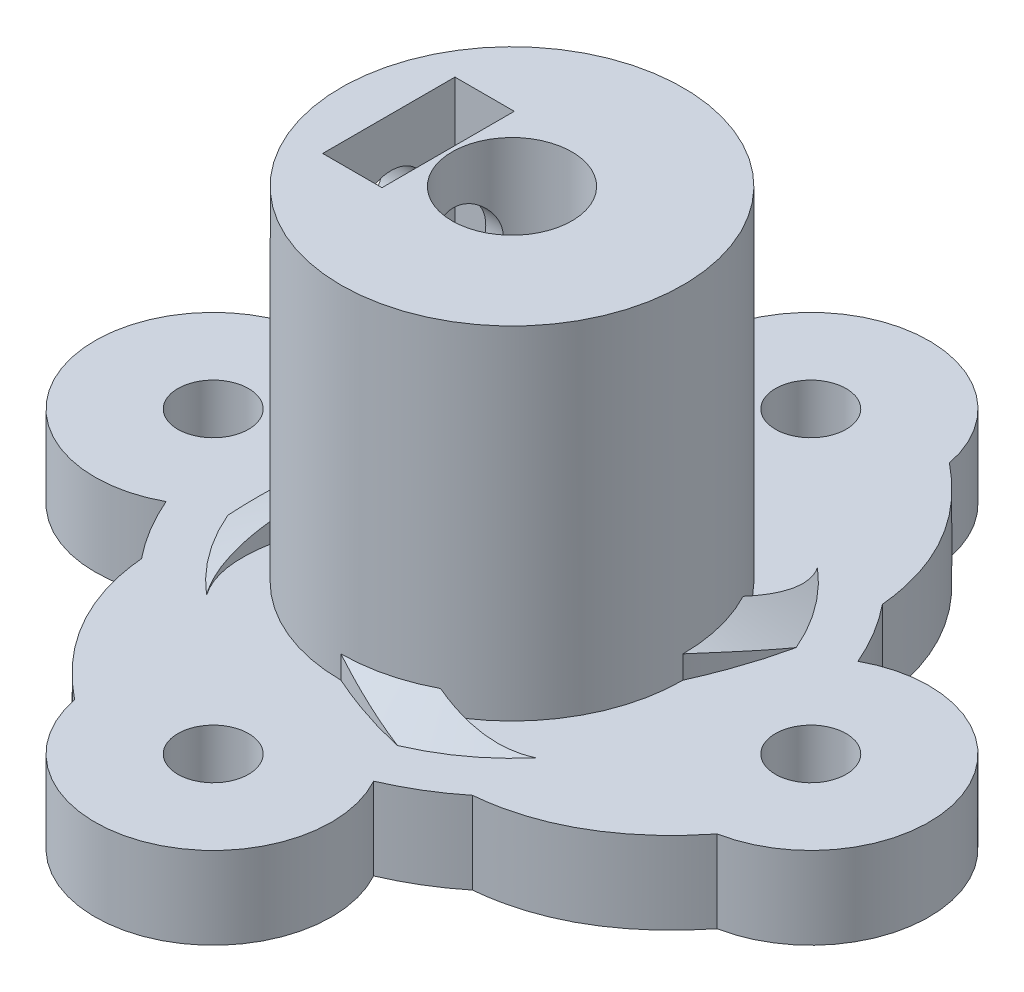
ISO-10303-21;
HEADER;
FILE_DESCRIPTION(('STEP AP214'),'2;1');
FILE_NAME('part.step','',(''),(''),'','','');
FILE_SCHEMA(('AUTOMOTIVE_DESIGN { 1 0 10303 214 1 1 1 1 }'));
ENDSEC;
DATA;
#1=APPLICATION_CONTEXT('core data for automotive mechanical design processes');
#2=APPLICATION_PROTOCOL_DEFINITION('international standard','automotive_design',2000,#1);
#3=PRODUCT_CONTEXT('',#1,'mechanical');
#4=PRODUCT('Part','Part','',(#3));
#5=PRODUCT_RELATED_PRODUCT_CATEGORY('part','',(#4));
#6=PRODUCT_DEFINITION_FORMATION('','',#4);
#7=PRODUCT_DEFINITION_CONTEXT('part definition',#1,'design');
#8=PRODUCT_DEFINITION('design','',#6,#7);
#9=PRODUCT_DEFINITION_SHAPE('','',#8);
#10=(LENGTH_UNIT() NAMED_UNIT(*) SI_UNIT(.MILLI.,.METRE.));
#11=(NAMED_UNIT(*) PLANE_ANGLE_UNIT() SI_UNIT($,.RADIAN.));
#12=(NAMED_UNIT(*) SI_UNIT($,.STERADIAN.) SOLID_ANGLE_UNIT());
#13=UNCERTAINTY_MEASURE_WITH_UNIT(LENGTH_MEASURE(1.E-05),#10,'distance_accuracy_value','');
#14=(GEOMETRIC_REPRESENTATION_CONTEXT(3) GLOBAL_UNCERTAINTY_ASSIGNED_CONTEXT((#13)) GLOBAL_UNIT_ASSIGNED_CONTEXT((#10,
#11,#12)) REPRESENTATION_CONTEXT('',''));
#15=CARTESIAN_POINT('',(0.,0.,0.));
#16=DIRECTION('',(0.,0.,1.));
#17=DIRECTION('',(1.,0.,0.));
#18=AXIS2_PLACEMENT_3D('',#15,#16,#17);
#19=CARTESIAN_POINT('',(2.44230296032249,-3.4,-15.8125));
#20=CARTESIAN_POINT('',(12.2012774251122,-3.4,-10.5838139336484));
#21=CARTESIAN_POINT('',(7.5,-3.4,0.));
#22=B_SPLINE_CURVE_WITH_KNOTS('',2,(#19,#20,#21),.UNSPECIFIED.,.F.,.F.,(3,3),(0.,1.),.UNSPECIFIED.);
#23=DIRECTION('',(0.,1.,0.));
#24=VECTOR('',#23,1.);
#25=SURFACE_OF_LINEAR_EXTRUSION('',#22,#24);
#26=DIRECTION('',(0.,1.,0.));
#27=VECTOR('',#26,1.);
#28=CARTESIAN_POINT('',(5.09028654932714,1.8,-14.086973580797));
#29=LINE('',#28,#27);
#30=CARTESIAN_POINT('',(5.09028654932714,3.6,-14.086973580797));
#31=VERTEX_POINT('',#30);
#32=CARTESIAN_POINT('',(5.09028654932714,0.,-14.086973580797));
#33=VERTEX_POINT('',#32);
#34=EDGE_CURVE('E561',#31,#33,#29,.F.);
#35=ORIENTED_EDGE('',*,*,#34,.F.);
#36=CARTESIAN_POINT('',(2.44230296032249,3.6,-15.8125));
#37=CARTESIAN_POINT('',(12.2012774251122,3.6,-10.5838139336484));
#38=CARTESIAN_POINT('',(7.5,3.6,0.));
#39=B_SPLINE_CURVE_WITH_KNOTS('',2,(#36,#37,#38),.UNSPECIFIED.,.F.,.F.,(3,3),(0.,1.),.UNSPECIFIED.);
#40=CARTESIAN_POINT('',(8.98623487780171,3.6,-7.25603767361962));
#41=VERTEX_POINT('',#40);
#42=EDGE_CURVE('E584',#31,#41,#39,.T.);
#43=ORIENTED_EDGE('',*,*,#42,.T.);
#44=DIRECTION('',(0.,1.,0.));
#45=VECTOR('',#44,1.);
#46=CARTESIAN_POINT('',(8.98623487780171,2.31380000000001,-7.25603767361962));
#47=LINE('',#46,#45);
#48=CARTESIAN_POINT('',(8.98623487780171,0.,-7.25603767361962));
#49=VERTEX_POINT('',#48);
#50=EDGE_CURVE('E582',#41,#49,#47,.F.);
#51=ORIENTED_EDGE('',*,*,#50,.T.);
#52=CARTESIAN_POINT('',(2.44230296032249,0.,-15.8125));
#53=CARTESIAN_POINT('',(12.2012774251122,0.,-10.5838139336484));
#54=CARTESIAN_POINT('',(7.5,0.,0.));
#55=B_SPLINE_CURVE_WITH_KNOTS('',2,(#52,#53,#54),.UNSPECIFIED.,.F.,.F.,(3,3),(0.,1.),.UNSPECIFIED.);
#56=EDGE_CURVE('E575',#33,#49,#55,.T.);
#57=ORIENTED_EDGE('',*,*,#56,.F.);
#58=EDGE_LOOP('',(#35,#43,#51,#57));
#59=FACE_BOUND('',#58,.T.);
#60=ADVANCED_FACE('F372',(#59),#25,.F.);
#61=CARTESIAN_POINT('',(0.,3.6,0.));
#62=DIRECTION('',(0.,-1.,0.));
#63=DIRECTION('',(0.,0.,-1.));
#64=AXIS2_PLACEMENT_3D('',#61,#62,#63);
#65=CYLINDRICAL_SURFACE('',#64,11.5500000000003);
#66=CARTESIAN_POINT('',(0.,3.6,0.));
#67=DIRECTION('',(0.,-1.,0.));
#68=DIRECTION('',(0.,0.,-1.));
#69=AXIS2_PLACEMENT_3D('',#66,#67,#68);
#70=CIRCLE('',#69,11.5500000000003);
#71=CARTESIAN_POINT('',(-7.25603767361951,3.6,-8.9862348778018));
#72=VERTEX_POINT('',#71);
#73=CARTESIAN_POINT('',(-4.55111347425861,3.6,-10.6155483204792));
#74=VERTEX_POINT('',#73);
#75=EDGE_CURVE('E799',#72,#74,#70,.T.);
#76=ORIENTED_EDGE('',*,*,#75,.T.);
#77=DIRECTION('',(0.,1.,0.));
#78=VECTOR('',#77,1.);
#79=CARTESIAN_POINT('',(-4.55111347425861,1.8,-10.6155483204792));
#80=LINE('',#79,#78);
#81=CARTESIAN_POINT('',(-4.55111347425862,0.,-10.6155483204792));
#82=VERTEX_POINT('',#81);
#83=EDGE_CURVE('E12',#74,#82,#80,.F.);
#84=ORIENTED_EDGE('',*,*,#83,.T.);
#85=CARTESIAN_POINT('',(0.,0.,0.));
#86=DIRECTION('',(0.,-1.,0.));
#87=DIRECTION('',(0.,0.,-1.));
#88=AXIS2_PLACEMENT_3D('',#85,#86,#87);
#89=CIRCLE('',#88,11.5500000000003);
#90=CARTESIAN_POINT('',(-7.25603767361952,0.,-8.9862348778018));
#91=VERTEX_POINT('',#90);
#92=EDGE_CURVE('E578',#91,#82,#89,.T.);
#93=ORIENTED_EDGE('',*,*,#92,.F.);
#94=DIRECTION('',(0.,1.,0.));
#95=VECTOR('',#94,1.);
#96=CARTESIAN_POINT('',(-7.25603767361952,2.3138,-8.9862348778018));
#97=LINE('',#96,#95);
#98=EDGE_CURVE('E875',#72,#91,#97,.F.);
#99=ORIENTED_EDGE('',*,*,#98,.F.);
#100=EDGE_LOOP('',(#76,#84,#93,#99));
#101=FACE_BOUND('',#100,.T.);
#102=ADVANCED_FACE('F687',(#101),#65,.T.);
#103=CARTESIAN_POINT('',(-2.44230296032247,-3.4,15.8125));
#104=CARTESIAN_POINT('',(-12.2012774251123,-3.4,10.5838139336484));
#105=CARTESIAN_POINT('',(-7.5,-3.4,0.));
#106=B_SPLINE_CURVE_WITH_KNOTS('',2,(#103,#104,#105),.UNSPECIFIED.,.F.,.F.,(3,3),(0.,1.),.UNSPECIFIED.);
#107=DIRECTION('',(0.,1.,0.));
#108=VECTOR('',#107,1.);
#109=SURFACE_OF_LINEAR_EXTRUSION('',#106,#108);
#110=DIRECTION('',(0.,1.,0.));
#111=VECTOR('',#110,1.);
#112=CARTESIAN_POINT('',(-5.09028654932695,1.8,14.0869735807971));
#113=LINE('',#112,#111);
#114=CARTESIAN_POINT('',(-5.09028654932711,3.6,14.0869735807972));
#115=VERTEX_POINT('',#114);
#116=CARTESIAN_POINT('',(-5.09028654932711,0.,14.0869735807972));
#117=VERTEX_POINT('',#116);
#118=EDGE_CURVE('E788',#115,#117,#113,.F.);
#119=ORIENTED_EDGE('',*,*,#118,.F.);
#120=CARTESIAN_POINT('',(-2.44230296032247,3.6,15.8125));
#121=CARTESIAN_POINT('',(-12.2012774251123,3.6,10.5838139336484));
#122=CARTESIAN_POINT('',(-7.5,3.6,0.));
#123=B_SPLINE_CURVE_WITH_KNOTS('',2,(#120,#121,#122),.UNSPECIFIED.,.F.,.F.,(3,3),(0.,1.),.UNSPECIFIED.);
#124=CARTESIAN_POINT('',(-8.98623487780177,3.6,7.25603767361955));
#125=VERTEX_POINT('',#124);
#126=EDGE_CURVE('E1080',#115,#125,#123,.T.);
#127=ORIENTED_EDGE('',*,*,#126,.T.);
#128=DIRECTION('',(0.,1.,0.));
#129=VECTOR('',#128,1.);
#130=CARTESIAN_POINT('',(-8.98623487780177,2.3138,7.25603767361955));
#131=LINE('',#130,#129);
#132=CARTESIAN_POINT('',(-8.98623487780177,0.,7.25603767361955));
#133=VERTEX_POINT('',#132);
#134=EDGE_CURVE('E873',#125,#133,#131,.F.);
#135=ORIENTED_EDGE('',*,*,#134,.T.);
#136=CARTESIAN_POINT('',(-2.44230296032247,0.,15.8125));
#137=CARTESIAN_POINT('',(-12.2012774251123,0.,10.5838139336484));
#138=CARTESIAN_POINT('',(-7.5,0.,0.));
#139=B_SPLINE_CURVE_WITH_KNOTS('',2,(#136,#137,#138),.UNSPECIFIED.,.F.,.F.,(3,3),(0.,1.),.UNSPECIFIED.);
#140=EDGE_CURVE('E939',#117,#133,#139,.T.);
#141=ORIENTED_EDGE('',*,*,#140,.F.);
#142=EDGE_LOOP('',(#119,#127,#135,#141));
#143=FACE_BOUND('',#142,.T.);
#144=ADVANCED_FACE('F1070',(#143),#109,.F.);
#145=CARTESIAN_POINT('',(7.25603767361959,3.6,8.98623487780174));
#146=VERTEX_POINT('',#145);
#147=CARTESIAN_POINT('',(4.55111347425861,3.6,10.6155483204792));
#148=VERTEX_POINT('',#147);
#149=EDGE_CURVE('E1117',#146,#148,#70,.T.);
#150=ORIENTED_EDGE('',*,*,#149,.T.);
#151=DIRECTION('',(0.,1.,0.));
#152=VECTOR('',#151,1.);
#153=CARTESIAN_POINT('',(4.55111347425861,1.8,10.6155483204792));
#154=LINE('',#153,#152);
#155=CARTESIAN_POINT('',(4.55111347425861,0.,10.6155483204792));
#156=VERTEX_POINT('',#155);
#157=EDGE_CURVE('E1112',#148,#156,#154,.F.);
#158=ORIENTED_EDGE('',*,*,#157,.T.);
#159=CARTESIAN_POINT('',(7.25603767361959,0.,8.98623487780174));
#160=VERTEX_POINT('',#159);
#161=EDGE_CURVE('E1106',#160,#156,#89,.T.);
#162=ORIENTED_EDGE('',*,*,#161,.F.);
#163=DIRECTION('',(0.,1.,0.));
#164=VECTOR('',#163,1.);
#165=CARTESIAN_POINT('',(7.25603767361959,2.3138,8.98623487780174));
#166=LINE('',#165,#164);
#167=EDGE_CURVE('E868',#146,#160,#166,.F.);
#168=ORIENTED_EDGE('',*,*,#167,.F.);
#169=EDGE_LOOP('',(#150,#158,#162,#168));
#170=FACE_BOUND('',#169,.T.);
#171=ADVANCED_FACE('F735',(#170),#65,.T.);
#172=CARTESIAN_POINT('',(0.,18.6,0.));
#173=DIRECTION('',(0.,-1.,0.));
#174=DIRECTION('',(0.,0.,-1.));
#175=AXIS2_PLACEMENT_3D('',#172,#173,#174);
#176=CYLINDRICAL_SURFACE('',#175,7.5);
#177=CARTESIAN_POINT('',(0.,18.6,0.));
#178=DIRECTION('',(0.,1.,0.));
#179=DIRECTION('',(0.,0.,1.));
#180=AXIS2_PLACEMENT_3D('',#177,#178,#179);
#181=CIRCLE('',#180,7.5);
#182=CARTESIAN_POINT('',(0.,18.6,7.5));
#183=VERTEX_POINT('',#182);
#184=EDGE_CURVE('E989',#183,#183,#181,.T.);
#185=ORIENTED_EDGE('',*,*,#184,.F.);
#186=EDGE_LOOP('',(#185));
#187=FACE_BOUND('',#186,.T.);
#188=CARTESIAN_POINT('',(-7.35849848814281,14.9,1.45));
#189=CARTESIAN_POINT('',(-7.3585001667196,14.9862100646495,1.44999690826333));
#190=CARTESIAN_POINT('',(-7.359931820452,15.0724586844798,1.44278348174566));
#191=CARTESIAN_POINT('',(-7.36548734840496,15.2425161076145,1.41414323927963));
#192=CARTESIAN_POINT('',(-7.36961329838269,15.3263229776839,1.39270546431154));
#193=CARTESIAN_POINT('',(-7.38004831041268,15.4890166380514,1.33630212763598));
#194=CARTESIAN_POINT('',(-7.38635529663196,15.5679080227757,1.30134942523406));
#195=CARTESIAN_POINT('',(-7.40040038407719,15.7187082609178,1.21893953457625));
#196=CARTESIAN_POINT('',(-7.40813841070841,15.7906174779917,1.17148299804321));
#197=CARTESIAN_POINT('',(-7.42423641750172,15.9263744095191,1.06473192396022));
#198=CARTESIAN_POINT('',(-7.43260273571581,15.9901152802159,1.00530243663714));
#199=CARTESIAN_POINT('',(-7.44887961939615,16.1067878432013,0.876580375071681));
#200=CARTESIAN_POINT('',(-7.4567901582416,16.1597189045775,0.807287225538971));
#201=CARTESIAN_POINT('',(-7.47125390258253,16.2536136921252,0.66019383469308));
#202=CARTESIAN_POINT('',(-7.4777972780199,16.2944915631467,0.582337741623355));
#203=CARTESIAN_POINT('',(-7.48862858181,16.3625498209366,0.420706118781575));
#204=CARTESIAN_POINT('',(-7.492916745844,16.3897316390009,0.33693120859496));
#205=CARTESIAN_POINT('',(-7.49861179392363,16.4292591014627,0.16712595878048));
#206=CARTESIAN_POINT('',(-7.50005916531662,16.4418121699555,0.0811452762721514));
#207=CARTESIAN_POINT('',(-7.49993712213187,16.452393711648,-0.0916988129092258));
#208=CARTESIAN_POINT('',(-7.49836797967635,16.4504234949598,-0.178562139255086));
#209=CARTESIAN_POINT('',(-7.49233428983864,16.4321693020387,-0.349497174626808));
#210=CARTESIAN_POINT('',(-7.48790827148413,16.4160747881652,-0.43359060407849));
#211=CARTESIAN_POINT('',(-7.47658837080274,16.3703495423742,-0.5978357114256));
#212=CARTESIAN_POINT('',(-7.46969435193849,16.340718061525,-0.677987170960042));
#213=CARTESIAN_POINT('',(-7.45401899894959,16.2684766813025,-0.832900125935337));
#214=CARTESIAN_POINT('',(-7.44522109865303,16.2257513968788,-0.907606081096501));
#215=CARTESIAN_POINT('',(-7.426639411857,16.1286217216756,-1.04886138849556));
#216=CARTESIAN_POINT('',(-7.41685549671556,16.0742158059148,-1.11540967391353));
#217=CARTESIAN_POINT('',(-7.39708779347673,15.9540137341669,-1.23981556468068));
#218=CARTESIAN_POINT('',(-7.38710380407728,15.8880173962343,-1.29747990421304));
#219=CARTESIAN_POINT('',(-7.3681837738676,15.7471612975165,-1.40094343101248));
#220=CARTESIAN_POINT('',(-7.35924774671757,15.6723014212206,-1.44674246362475));
#221=CARTESIAN_POINT('',(-7.34339745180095,15.5156964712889,-1.52516335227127));
#222=CARTESIAN_POINT('',(-7.33648461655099,15.4339465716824,-1.55777587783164));
#223=CARTESIAN_POINT('',(-7.3254792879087,15.2659375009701,-1.60873868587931));
#224=CARTESIAN_POINT('',(-7.32138634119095,15.1796790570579,-1.62709126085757));
#225=CARTESIAN_POINT('',(-7.31655195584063,15.0070439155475,-1.64869298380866));
#226=CARTESIAN_POINT('',(-7.31574191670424,14.9207077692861,-1.65225131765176));
#227=CARTESIAN_POINT('',(-7.31737673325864,14.7486773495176,-1.64499580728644));
#228=CARTESIAN_POINT('',(-7.31982136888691,14.6629830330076,-1.63418293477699));
#229=CARTESIAN_POINT('',(-7.32764076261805,14.4956740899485,-1.59874967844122));
#230=CARTESIAN_POINT('',(-7.33298173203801,14.4140240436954,-1.57428842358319));
#231=CARTESIAN_POINT('',(-7.34598956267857,14.2559831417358,-1.51242532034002));
#232=CARTESIAN_POINT('',(-7.3536566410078,14.1795927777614,-1.47502226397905));
#233=CARTESIAN_POINT('',(-7.37064223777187,14.0329384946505,-1.38767275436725));
#234=CARTESIAN_POINT('',(-7.37998445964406,13.9627875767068,-1.33754128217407));
#235=CARTESIAN_POINT('',(-7.39926284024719,13.8317869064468,-1.22641059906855));
#236=CARTESIAN_POINT('',(-7.4091990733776,13.7709383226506,-1.16541002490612));
#237=CARTESIAN_POINT('',(-7.4288442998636,13.6590727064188,-1.03287797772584));
#238=CARTESIAN_POINT('',(-7.43854526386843,13.6082669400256,-0.961166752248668));
#239=CARTESIAN_POINT('',(-7.45651259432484,13.5194231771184,-0.810062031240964));
#240=CARTESIAN_POINT('',(-7.46477900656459,13.4813847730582,-0.730668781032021));
#241=CARTESIAN_POINT('',(-7.47900268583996,13.4193751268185,-0.566786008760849));
#242=CARTESIAN_POINT('',(-7.48497042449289,13.3953398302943,-0.48232167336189));
#243=CARTESIAN_POINT('',(-7.49406778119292,13.3618529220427,-0.310404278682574));
#244=CARTESIAN_POINT('',(-7.49719778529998,13.3523993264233,-0.22295162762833));
#245=CARTESIAN_POINT('',(-7.50032990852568,13.3484442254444,-0.0493826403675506));
#246=CARTESIAN_POINT('',(-7.50039242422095,13.3536518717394,0.0367260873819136));
#247=CARTESIAN_POINT('',(-7.49762992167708,13.3782466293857,0.206842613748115));
#248=CARTESIAN_POINT('',(-7.49480498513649,13.3976333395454,0.290850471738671));
#249=CARTESIAN_POINT('',(-7.48669164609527,13.449857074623,0.453970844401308));
#250=CARTESIAN_POINT('',(-7.48141576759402,13.4826256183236,0.533105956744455));
#251=CARTESIAN_POINT('',(-7.46905897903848,13.5606496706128,0.684804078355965));
#252=CARTESIAN_POINT('',(-7.46197793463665,13.6059061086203,0.757366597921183));
#253=CARTESIAN_POINT('',(-7.44672545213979,13.7084430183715,0.895075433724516));
#254=CARTESIAN_POINT('',(-7.43853882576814,13.7658988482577,0.960089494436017));
#255=CARTESIAN_POINT('',(-7.42212886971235,13.8908450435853,1.07965452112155));
#256=CARTESIAN_POINT('',(-7.41390553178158,13.9583377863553,1.13420300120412));
#257=CARTESIAN_POINT('',(-7.39829939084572,14.1024204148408,1.2319301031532));
#258=CARTESIAN_POINT('',(-7.39092810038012,14.1791114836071,1.27496147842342));
#259=CARTESIAN_POINT('',(-7.37805466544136,14.3387499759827,1.34747023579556));
#260=CARTESIAN_POINT('',(-7.37255090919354,14.4216919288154,1.37695931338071));
#261=CARTESIAN_POINT('',(-7.36512545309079,14.5706452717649,1.41605537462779));
#262=CARTESIAN_POINT('',(-7.36265680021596,14.6358337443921,1.42876162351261));
#263=CARTESIAN_POINT('',(-7.35934269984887,14.7673405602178,1.4457349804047));
#264=CARTESIAN_POINT('',(-7.35849719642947,14.8336588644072,1.4500023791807));
#265=CARTESIAN_POINT('',(-7.35849848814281,14.9,1.45));
#266=B_SPLINE_CURVE_WITH_KNOTS('',3,(#188,#189,#190,#191,#192,#193,#194,#195,#196,#197,#198,
#199,#200,#201,#202,#203,#204,#205,#206,#207,#208,#209,#210,#211,#212,#213,#214,#215,#216,#217,
#218,#219,#220,#221,#222,#223,#224,#225,#226,#227,#228,#229,#230,#231,#232,#233,#234,#235,#236,
#237,#238,#239,#240,#241,#242,#243,#244,#245,#246,#247,#248,#249,#250,#251,#252,#253,#254,#255,
#256,#257,#258,#259,#260,#261,#262,#263,#264,#265),.UNSPECIFIED.,.T.,.F.,(4,2,2,2,2,2,2,2,2,2,2,
2,2,2,2,2,2,2,2,2,2,2,2,2,2,2,2,2,2,2,2,2,2,2,2,2,2,2,4),(0.,0.258387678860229,
0.516974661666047,0.775316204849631,1.03364428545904,1.29506572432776,1.55650241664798,
1.81975867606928,2.08298741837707,2.34243653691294,2.60186225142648,2.85786034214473,
3.11387259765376,3.37220911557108,3.63057938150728,3.89395333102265,4.15733071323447,
4.42089413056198,4.6844151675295,4.94240028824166,5.20036796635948,5.4553889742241,
5.71043379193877,5.9694224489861,6.22844361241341,6.49243945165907,6.75642686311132,
7.01919704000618,7.28193146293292,7.5394907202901,7.7970426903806,8.05329283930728,
8.30956206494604,8.56980004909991,8.83009977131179,9.09358366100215,9.35683956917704,
9.55568320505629,9.75451998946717),.UNSPECIFIED.);
#267=CARTESIAN_POINT('',(-7.35849848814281,14.9,1.45));
#268=VERTEX_POINT('',#267);
#269=EDGE_CURVE('E711',#268,#268,#266,.T.);
#270=ORIENTED_EDGE('',*,*,#269,.F.);
#271=EDGE_LOOP('',(#270));
#272=FACE_BOUND('',#271,.T.);
#273=CARTESIAN_POINT('',(0.,3.6,0.));
#274=DIRECTION('',(0.,-1.,0.));
#275=DIRECTION('',(0.,0.,-1.));
#276=AXIS2_PLACEMENT_3D('',#273,#274,#275);
#277=CIRCLE('',#276,7.5);
#278=CARTESIAN_POINT('',(0.,3.6,-7.5));
#279=VERTEX_POINT('',#278);
#280=CARTESIAN_POINT('',(6.6332495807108,3.6,-3.5));
#281=VERTEX_POINT('',#280);
#282=EDGE_CURVE('E825',#279,#281,#277,.T.);
#283=ORIENTED_EDGE('',*,*,#282,.F.);
#284=DIRECTION('',(0.,1.,0.));
#285=VECTOR('',#284,1.);
#286=CARTESIAN_POINT('',(0.,-3.4,-7.5));
#287=LINE('',#286,#285);
#288=CARTESIAN_POINT('',(0.,4.6,-7.5));
#289=VERTEX_POINT('',#288);
#290=EDGE_CURVE('E956',#279,#289,#287,.T.);
#291=ORIENTED_EDGE('',*,*,#290,.T.);
#292=CARTESIAN_POINT('',(0.,4.6,0.));
#293=DIRECTION('',(0.,1.,0.));
#294=DIRECTION('',(0.,0.,1.));
#295=AXIS2_PLACEMENT_3D('',#292,#293,#294);
#296=CIRCLE('',#295,7.5);
#297=CARTESIAN_POINT('',(-3.5,4.6,-6.6332495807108));
#298=VERTEX_POINT('',#297);
#299=EDGE_CURVE('E898',#289,#298,#296,.T.);
#300=ORIENTED_EDGE('',*,*,#299,.T.);
#301=DIRECTION('',(0.,1.,0.));
#302=VECTOR('',#301,1.);
#303=CARTESIAN_POINT('',(-3.5,-3.4,-6.6332495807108));
#304=LINE('',#303,#302);
#305=CARTESIAN_POINT('',(-3.5,3.6,-6.6332495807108));
#306=VERTEX_POINT('',#305);
#307=EDGE_CURVE('E1093',#306,#298,#304,.T.);
#308=ORIENTED_EDGE('',*,*,#307,.F.);
#309=CARTESIAN_POINT('',(-7.5,3.6,0.));
#310=VERTEX_POINT('',#309);
#311=EDGE_CURVE('E819',#310,#306,#277,.T.);
#312=ORIENTED_EDGE('',*,*,#311,.F.);
#313=DIRECTION('',(0.,1.,0.));
#314=VECTOR('',#313,1.);
#315=CARTESIAN_POINT('',(-7.5,-3.4,0.));
#316=LINE('',#315,#314);
#317=CARTESIAN_POINT('',(-7.5,4.6,0.));
#318=VERTEX_POINT('',#317);
#319=EDGE_CURVE('E1057',#310,#318,#316,.T.);
#320=ORIENTED_EDGE('',*,*,#319,.T.);
#321=CARTESIAN_POINT('',(0.,4.6,0.));
#322=DIRECTION('',(0.,1.,0.));
#323=DIRECTION('',(0.,0.,1.));
#324=AXIS2_PLACEMENT_3D('',#321,#322,#323);
#325=CIRCLE('',#324,7.5);
#326=CARTESIAN_POINT('',(-6.6332495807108,4.6,3.5));
#327=VERTEX_POINT('',#326);
#328=EDGE_CURVE('E889',#318,#327,#325,.T.);
#329=ORIENTED_EDGE('',*,*,#328,.T.);
#330=DIRECTION('',(0.,1.,0.));
#331=VECTOR('',#330,1.);
#332=CARTESIAN_POINT('',(-6.6332495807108,-3.4,3.5));
#333=LINE('',#332,#331);
#334=CARTESIAN_POINT('',(-6.6332495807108,3.6,3.50000000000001));
#335=VERTEX_POINT('',#334);
#336=EDGE_CURVE('E583',#335,#327,#333,.T.);
#337=ORIENTED_EDGE('',*,*,#336,.F.);
#338=CARTESIAN_POINT('',(0.,3.6,7.5));
#339=VERTEX_POINT('',#338);
#340=EDGE_CURVE('E824',#339,#335,#277,.T.);
#341=ORIENTED_EDGE('',*,*,#340,.F.);
#342=DIRECTION('',(0.,1.,0.));
#343=VECTOR('',#342,1.);
#344=CARTESIAN_POINT('',(0.,-3.4,7.5));
#345=LINE('',#344,#343);
#346=CARTESIAN_POINT('',(0.,4.6,7.5));
#347=VERTEX_POINT('',#346);
#348=EDGE_CURVE('E586',#339,#347,#345,.T.);
#349=ORIENTED_EDGE('',*,*,#348,.T.);
#350=CARTESIAN_POINT('',(0.,4.6,0.));
#351=DIRECTION('',(0.,1.,0.));
#352=DIRECTION('',(0.,0.,1.));
#353=AXIS2_PLACEMENT_3D('',#350,#351,#352);
#354=CIRCLE('',#353,7.5);
#355=CARTESIAN_POINT('',(3.5,4.6,6.6332495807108));
#356=VERTEX_POINT('',#355);
#357=EDGE_CURVE('E892',#347,#356,#354,.T.);
#358=ORIENTED_EDGE('',*,*,#357,.T.);
#359=DIRECTION('',(0.,1.,0.));
#360=VECTOR('',#359,1.);
#361=CARTESIAN_POINT('',(3.5,-3.4,6.6332495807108));
#362=LINE('',#361,#360);
#363=CARTESIAN_POINT('',(3.5,3.6,6.6332495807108));
#364=VERTEX_POINT('',#363);
#365=EDGE_CURVE('E707',#364,#356,#362,.T.);
#366=ORIENTED_EDGE('',*,*,#365,.F.);
#367=CARTESIAN_POINT('',(7.5,3.6,1.05375318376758E-13));
#368=VERTEX_POINT('',#367);
#369=EDGE_CURVE('E845',#368,#364,#277,.T.);
#370=ORIENTED_EDGE('',*,*,#369,.F.);
#371=DIRECTION('',(0.,1.,0.));
#372=VECTOR('',#371,1.);
#373=CARTESIAN_POINT('',(7.5,-3.4,1.05375318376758E-13));
#374=LINE('',#373,#372);
#375=CARTESIAN_POINT('',(7.5,4.6,1.05375318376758E-13));
#376=VERTEX_POINT('',#375);
#377=EDGE_CURVE('E588',#368,#376,#374,.T.);
#378=ORIENTED_EDGE('',*,*,#377,.T.);
#379=CARTESIAN_POINT('',(0.,4.6,0.));
#380=DIRECTION('',(0.,1.,0.));
#381=DIRECTION('',(0.,0.,1.));
#382=AXIS2_PLACEMENT_3D('',#379,#380,#381);
#383=CIRCLE('',#382,7.5);
#384=CARTESIAN_POINT('',(6.6332495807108,4.6,-3.5));
#385=VERTEX_POINT('',#384);
#386=EDGE_CURVE('E895',#376,#385,#383,.T.);
#387=ORIENTED_EDGE('',*,*,#386,.T.);
#388=DIRECTION('',(0.,1.,0.));
#389=VECTOR('',#388,1.);
#390=CARTESIAN_POINT('',(6.6332495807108,-3.4,-3.5));
#391=LINE('',#390,#389);
#392=EDGE_CURVE('E957',#281,#385,#391,.T.);
#393=ORIENTED_EDGE('',*,*,#392,.F.);
#394=EDGE_LOOP('',(#283,#291,#300,#308,#312,#320,#329,#337,#341,#349,#358,#366,#370,#378,#387,#393));
#395=FACE_BOUND('',#394,.T.);
#396=ADVANCED_FACE('F729',(#187,#272,#395),#176,.T.);
#397=CARTESIAN_POINT('',(0.,-3.4,-9.45));
#398=CARTESIAN_POINT('',(7.93333966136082,-3.4,-9.19804260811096));
#399=CARTESIAN_POINT('',(6.6332495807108,-3.4,-3.5));
#400=B_SPLINE_CURVE_WITH_KNOTS('',2,(#397,#398,#399),.UNSPECIFIED.,.F.,.F.,(3,3),(0.,1.),.UNSPECIFIED.);
#401=DIRECTION('',(0.,1.,0.));
#402=VECTOR('',#401,1.);
#403=SURFACE_OF_LINEAR_EXTRUSION('',#400,#402);
#404=CARTESIAN_POINT('',(6.6332495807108,4.6,-3.5));
#405=CARTESIAN_POINT('',(6.65035004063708,4.57494689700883,-3.57495807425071));
#406=CARTESIAN_POINT('',(6.66647197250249,4.54993317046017,-3.65015159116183));
#407=CARTESIAN_POINT('',(6.69658567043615,4.5000450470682,-3.80102439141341));
#408=CARTESIAN_POINT('',(6.71057705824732,4.47517067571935,-3.87670375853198));
#409=CARTESIAN_POINT('',(6.74916533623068,4.40070970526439,-4.1049160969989));
#410=CARTESIAN_POINT('',(6.77026980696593,4.35143891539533,-4.25816595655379));
#411=CARTESIAN_POINT('',(6.80174895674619,4.2533923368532,-4.56948043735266));
#412=CARTESIAN_POINT('',(6.811893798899,4.20464762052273,-4.72757922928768));
#413=CARTESIAN_POINT('',(6.81842570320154,4.10963497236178,-5.04459637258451));
#414=CARTESIAN_POINT('',(6.8148309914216,4.06336384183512,-5.20351335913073));
#415=CARTESIAN_POINT('',(6.78804225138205,3.96199020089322,-5.56500895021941));
#416=CARTESIAN_POINT('',(6.75973963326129,3.90794949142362,-5.76759961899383));
#417=CARTESIAN_POINT('',(6.69357420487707,3.83329926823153,-6.06681648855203));
#418=CARTESIAN_POINT('',(6.66772073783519,3.80956856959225,-6.16538315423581));
#419=CARTESIAN_POINT('',(6.60769360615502,3.76445477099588,-6.36047705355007));
#420=CARTESIAN_POINT('',(6.57352325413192,3.74307074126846,-6.45700508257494));
#421=CARTESIAN_POINT('',(6.48772481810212,3.69834911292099,-6.66890363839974));
#422=CARTESIAN_POINT('',(6.43389188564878,3.67568107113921,-6.78354154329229));
#423=CARTESIAN_POINT('',(6.34320959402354,3.64488327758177,-6.95124822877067));
#424=CARTESIAN_POINT('',(6.31117012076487,3.63511704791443,-7.00666688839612));
#425=CARTESIAN_POINT('',(6.24388587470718,3.61670999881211,-7.11574287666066));
#426=CARTESIAN_POINT('',(6.20864001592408,3.60806956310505,-7.16939960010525));
#427=CARTESIAN_POINT('',(6.17183947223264,3.6,-7.22207709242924));
#428=B_SPLINE_CURVE_WITH_KNOTS('',3,(#404,#405,#406,#407,#408,#409,#410,#411,#412,#413,#414,
#415,#416,#417,#418,#419,#420,#421,#422,#423,#424,#425,#426,#427),.UNSPECIFIED.,.F.,.F.,(4,2,2,
2,2,2,2,2,2,2,2,4),(0.,0.242577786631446,0.485198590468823,0.971920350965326,1.46866217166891,
1.96474527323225,2.59698742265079,2.91055150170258,3.22399089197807,3.60902869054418,
3.80319376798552,3.99742485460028),.UNSPECIFIED.);
#429=CARTESIAN_POINT('',(6.17183947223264,3.6,-7.22207709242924));
#430=VERTEX_POINT('',#429);
#431=EDGE_CURVE('E670',#385,#430,#428,.T.);
#432=ORIENTED_EDGE('',*,*,#431,.T.);
#433=CARTESIAN_POINT('',(0.,3.6,-9.45));
#434=CARTESIAN_POINT('',(7.93333966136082,3.6,-9.19804260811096));
#435=CARTESIAN_POINT('',(6.6332495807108,3.6,-3.5));
#436=B_SPLINE_CURVE_WITH_KNOTS('',2,(#433,#434,#435),.UNSPECIFIED.,.F.,.F.,(3,3),(0.,1.),.UNSPECIFIED.);
#437=EDGE_CURVE('E853',#430,#281,#436,.T.);
#438=ORIENTED_EDGE('',*,*,#437,.T.);
#439=ORIENTED_EDGE('',*,*,#392,.T.);
#440=EDGE_LOOP('',(#432,#438,#439));
#441=FACE_BOUND('',#440,.T.);
#442=ADVANCED_FACE('F734',(#441),#403,.T.);
#443=CARTESIAN_POINT('',(-15.8125,-3.4,-2.44230296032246));
#444=CARTESIAN_POINT('',(-10.5838139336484,-3.4,-12.2012774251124));
#445=CARTESIAN_POINT('',(0.,-3.4,-7.5));
#446=B_SPLINE_CURVE_WITH_KNOTS('',2,(#443,#444,#445),.UNSPECIFIED.,.F.,.F.,(3,3),(0.,1.),.UNSPECIFIED.);
#447=DIRECTION('',(0.,1.,0.));
#448=VECTOR('',#447,1.);
#449=SURFACE_OF_LINEAR_EXTRUSION('',#446,#448);
#450=CARTESIAN_POINT('',(-15.8125,3.6,-2.44230296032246));
#451=CARTESIAN_POINT('',(-10.5838139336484,3.6,-12.2012774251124));
#452=CARTESIAN_POINT('',(0.,3.6,-7.5));
#453=B_SPLINE_CURVE_WITH_KNOTS('',2,(#450,#451,#452),.UNSPECIFIED.,.F.,.F.,(3,3),(0.,1.),.UNSPECIFIED.);
#454=CARTESIAN_POINT('',(-3.71921164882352,3.6,-8.7417083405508));
#455=VERTEX_POINT('',#454);
#456=EDGE_CURVE('E860',#455,#279,#453,.T.);
#457=ORIENTED_EDGE('',*,*,#456,.F.);
#458=CARTESIAN_POINT('',(-3.71921164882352,3.6,-8.7417083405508));
#459=CARTESIAN_POINT('',(-3.59175731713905,3.6373900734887,-8.71466290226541));
#460=CARTESIAN_POINT('',(-3.46461461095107,3.67460389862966,-8.6859240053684));
#461=CARTESIAN_POINT('',(-3.21121743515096,3.74848202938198,-8.62528061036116));
#462=CARTESIAN_POINT('',(-3.08496169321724,3.78514728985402,-8.59338259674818));
#463=CARTESIAN_POINT('',(-2.83326900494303,3.8578311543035,-8.52657953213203));
#464=CARTESIAN_POINT('',(-2.70783115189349,3.89385060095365,-8.49167880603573));
#465=CARTESIAN_POINT('',(-2.4577041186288,3.96513524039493,-8.41900925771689));
#466=CARTESIAN_POINT('',(-2.33301437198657,4.00040107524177,-8.38124301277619));
#467=CARTESIAN_POINT('',(-2.08431551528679,4.0700615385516,-8.30296684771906));
#468=CARTESIAN_POINT('',(-1.9603061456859,4.10445652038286,-8.26245806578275));
#469=CARTESIAN_POINT('',(-1.71292352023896,4.17224144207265,-8.1788147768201));
#470=CARTESIAN_POINT('',(-1.58955016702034,4.20563153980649,-8.13568068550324));
#471=CARTESIAN_POINT('',(-1.34334108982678,4.27127693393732,-8.04687430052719));
#472=CARTESIAN_POINT('',(-1.22050567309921,4.30353164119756,-8.00120071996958));
#473=CARTESIAN_POINT('',(-0.975301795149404,4.36675630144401,-7.90739860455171));
#474=CARTESIAN_POINT('',(-0.852933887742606,4.39772500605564,-7.85926778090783));
#475=CARTESIAN_POINT('',(-0.608595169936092,4.45821543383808,-7.76062384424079));
#476=CARTESIAN_POINT('',(-0.486625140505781,4.48773510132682,-7.71010753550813));
#477=CARTESIAN_POINT('',(-0.243013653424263,4.54514984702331,-7.60675376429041));
#478=CARTESIAN_POINT('',(-0.121373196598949,4.5730418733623,-7.55391224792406));
#479=CARTESIAN_POINT('',(0.,4.6,-7.5));
#480=B_SPLINE_CURVE_WITH_KNOTS('',3,(#458,#459,#460,#461,#462,#463,#464,#465,#466,#467,#468,
#469,#470,#471,#472,#473,#474,#475,#476,#477,#478,#479),.UNSPECIFIED.,.F.,.F.,(4,2,2,2,2,2,2,2,
2,2,4),(0.,0.406636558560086,0.812455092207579,1.21769859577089,1.6225818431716,
2.02729807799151,2.43195039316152,2.83680967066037,3.24205318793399,3.64785590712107,
4.05439656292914),.UNSPECIFIED.);
#481=EDGE_CURVE('E919',#455,#289,#480,.T.);
#482=ORIENTED_EDGE('',*,*,#481,.T.);
#483=ORIENTED_EDGE('',*,*,#290,.F.);
#484=EDGE_LOOP('',(#457,#482,#483));
#485=FACE_BOUND('',#484,.T.);
#486=ADVANCED_FACE('F931',(#485),#449,.F.);
#487=CARTESIAN_POINT('',(-9.45,-3.4,0.));
#488=CARTESIAN_POINT('',(-9.19804260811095,-3.4,-7.93333966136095));
#489=CARTESIAN_POINT('',(-3.5,-3.4,-6.6332495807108));
#490=B_SPLINE_CURVE_WITH_KNOTS('',2,(#487,#488,#489),.UNSPECIFIED.,.F.,.F.,(3,3),(0.,1.),.UNSPECIFIED.);
#491=DIRECTION('',(0.,1.,0.));
#492=VECTOR('',#491,1.);
#493=SURFACE_OF_LINEAR_EXTRUSION('',#490,#492);
#494=CARTESIAN_POINT('',(-3.5,4.6,-6.6332495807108));
#495=CARTESIAN_POINT('',(-3.57495807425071,4.57494689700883,-6.65035004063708));
#496=CARTESIAN_POINT('',(-3.65015159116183,4.54993317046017,-6.66647197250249));
#497=CARTESIAN_POINT('',(-3.8010243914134,4.5000450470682,-6.69658567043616));
#498=CARTESIAN_POINT('',(-3.87670375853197,4.47517067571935,-6.71057705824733));
#499=CARTESIAN_POINT('',(-4.10491609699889,4.40070970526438,-6.74916533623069));
#500=CARTESIAN_POINT('',(-4.25816595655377,4.35143891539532,-6.77026980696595));
#501=CARTESIAN_POINT('',(-4.56948043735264,4.2533923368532,-6.80174895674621));
#502=CARTESIAN_POINT('',(-4.72757922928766,4.20464762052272,-6.81189379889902));
#503=CARTESIAN_POINT('',(-5.04459637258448,4.10963497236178,-6.81842570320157));
#504=CARTESIAN_POINT('',(-5.2035133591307,4.06336384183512,-6.81483099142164));
#505=CARTESIAN_POINT('',(-5.56500895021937,3.96199020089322,-6.78804225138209));
#506=CARTESIAN_POINT('',(-5.76759961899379,3.90794949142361,-6.75973963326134));
#507=CARTESIAN_POINT('',(-6.06681648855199,3.83329926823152,-6.69357420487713));
#508=CARTESIAN_POINT('',(-6.16538315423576,3.80956856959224,-6.66772073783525));
#509=CARTESIAN_POINT('',(-6.36047705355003,3.76445477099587,-6.60769360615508));
#510=CARTESIAN_POINT('',(-6.4570050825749,3.74307074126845,-6.57352325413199));
#511=CARTESIAN_POINT('',(-6.66890363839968,3.69834911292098,-6.4877248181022));
#512=CARTESIAN_POINT('',(-6.78354154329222,3.67568107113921,-6.43389188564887));
#513=CARTESIAN_POINT('',(-6.95124822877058,3.64488327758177,-6.34320959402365));
#514=CARTESIAN_POINT('',(-7.00666688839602,3.63511704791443,-6.31117012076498));
#515=CARTESIAN_POINT('',(-7.11574287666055,3.61670999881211,-6.2438858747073));
#516=CARTESIAN_POINT('',(-7.16939960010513,3.60806956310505,-6.20864001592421));
#517=CARTESIAN_POINT('',(-7.22207709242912,3.6,-6.17183947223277));
#518=B_SPLINE_CURVE_WITH_KNOTS('',3,(#494,#495,#496,#497,#498,#499,#500,#501,#502,#503,#504,
#505,#506,#507,#508,#509,#510,#511,#512,#513,#514,#515,#516,#517),.UNSPECIFIED.,.F.,.F.,(4,2,2,
2,2,2,2,2,2,2,2,4),(0.,0.242577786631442,0.485198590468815,0.971920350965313,1.46866217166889,
1.96474527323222,2.59698742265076,2.91055150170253,3.22399089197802,3.60902869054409,
3.80319376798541,3.99742485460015),.UNSPECIFIED.);
#519=CARTESIAN_POINT('',(-7.22207709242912,3.6,-6.17183947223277));
#520=VERTEX_POINT('',#519);
#521=EDGE_CURVE('E913',#298,#520,#518,.T.);
#522=ORIENTED_EDGE('',*,*,#521,.T.);
#523=CARTESIAN_POINT('',(-9.45,3.6,0.));
#524=CARTESIAN_POINT('',(-9.19804260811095,3.6,-7.93333966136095));
#525=CARTESIAN_POINT('',(-3.5,3.6,-6.6332495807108));
#526=B_SPLINE_CURVE_WITH_KNOTS('',2,(#523,#524,#525),.UNSPECIFIED.,.F.,.F.,(3,3),(0.,1.),.UNSPECIFIED.);
#527=EDGE_CURVE('E830',#520,#306,#526,.T.);
#528=ORIENTED_EDGE('',*,*,#527,.T.);
#529=ORIENTED_EDGE('',*,*,#307,.T.);
#530=EDGE_LOOP('',(#522,#528,#529));
#531=FACE_BOUND('',#530,.T.);
#532=ADVANCED_FACE('F629',(#531),#493,.T.);
#533=CARTESIAN_POINT('',(-2.44230296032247,3.6,15.8125));
#534=CARTESIAN_POINT('',(-12.2012774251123,3.6,10.5838139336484));
#535=CARTESIAN_POINT('',(-7.5,3.6,0.));
#536=B_SPLINE_CURVE_WITH_KNOTS('',2,(#533,#534,#535),.UNSPECIFIED.,.F.,.F.,(3,3),(0.,1.),.UNSPECIFIED.);
#537=CARTESIAN_POINT('',(-8.74170834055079,3.6,3.71921164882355));
#538=VERTEX_POINT('',#537);
#539=EDGE_CURVE('E812',#538,#310,#536,.T.);
#540=ORIENTED_EDGE('',*,*,#539,.F.);
#541=CARTESIAN_POINT('',(-8.74170834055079,3.6,3.71921164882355));
#542=CARTESIAN_POINT('',(-8.71466290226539,3.6373900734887,3.59175731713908));
#543=CARTESIAN_POINT('',(-8.68592400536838,3.67460389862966,3.4646146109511));
#544=CARTESIAN_POINT('',(-8.62528061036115,3.74848202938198,3.211217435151));
#545=CARTESIAN_POINT('',(-8.59338259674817,3.78514728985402,3.08496169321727));
#546=CARTESIAN_POINT('',(-8.52657953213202,3.8578311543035,2.83326900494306));
#547=CARTESIAN_POINT('',(-8.49167880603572,3.89385060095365,2.70783115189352));
#548=CARTESIAN_POINT('',(-8.41900925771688,3.96513524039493,2.45770411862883));
#549=CARTESIAN_POINT('',(-8.38124301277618,4.00040107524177,2.3330143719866));
#550=CARTESIAN_POINT('',(-8.30296684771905,4.07006153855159,2.08431551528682));
#551=CARTESIAN_POINT('',(-8.26245806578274,4.10445652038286,1.96030614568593));
#552=CARTESIAN_POINT('',(-8.1788147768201,4.17224144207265,1.71292352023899));
#553=CARTESIAN_POINT('',(-8.13568068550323,4.20563153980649,1.58955016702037));
#554=CARTESIAN_POINT('',(-8.04687430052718,4.27127693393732,1.34334108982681));
#555=CARTESIAN_POINT('',(-8.00120071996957,4.30353164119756,1.22050567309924));
#556=CARTESIAN_POINT('',(-7.90739860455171,4.36675630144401,0.975301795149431));
#557=CARTESIAN_POINT('',(-7.85926778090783,4.39772500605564,0.852933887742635));
#558=CARTESIAN_POINT('',(-7.76062384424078,4.45821543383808,0.60859516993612));
#559=CARTESIAN_POINT('',(-7.71010753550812,4.48773510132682,0.486625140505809));
#560=CARTESIAN_POINT('',(-7.60675376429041,4.54514984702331,0.243013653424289));
#561=CARTESIAN_POINT('',(-7.55391224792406,4.5730418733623,0.121373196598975));
#562=CARTESIAN_POINT('',(-7.5,4.6,0.));
#563=B_SPLINE_CURVE_WITH_KNOTS('',3,(#541,#542,#543,#544,#545,#546,#547,#548,#549,#550,#551,
#552,#553,#554,#555,#556,#557,#558,#559,#560,#561,#562),.UNSPECIFIED.,.F.,.F.,(4,2,2,2,2,2,2,2,
2,2,4),(0.,0.406636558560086,0.81245509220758,1.21769859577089,1.6225818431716,2.02729807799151,
2.43195039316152,2.83680967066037,3.242053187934,3.64785590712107,4.05439656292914),.UNSPECIFIED.);
#564=EDGE_CURVE('E1061',#538,#318,#563,.T.);
#565=ORIENTED_EDGE('',*,*,#564,.T.);
#566=ORIENTED_EDGE('',*,*,#319,.F.);
#567=EDGE_LOOP('',(#540,#565,#566));
#568=FACE_BOUND('',#567,.T.);
#569=ADVANCED_FACE('F1075',(#568),#109,.F.);
#570=CARTESIAN_POINT('',(0.,-3.4,9.45));
#571=CARTESIAN_POINT('',(-7.93333966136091,-3.4,9.19804260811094));
#572=CARTESIAN_POINT('',(-6.6332495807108,-3.4,3.50000000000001));
#573=B_SPLINE_CURVE_WITH_KNOTS('',2,(#570,#571,#572),.UNSPECIFIED.,.F.,.F.,(3,3),(0.,1.),.UNSPECIFIED.);
#574=DIRECTION('',(0.,1.,0.));
#575=VECTOR('',#574,1.);
#576=SURFACE_OF_LINEAR_EXTRUSION('',#573,#575);
#577=CARTESIAN_POINT('',(-6.6332495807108,4.6,3.5));
#578=CARTESIAN_POINT('',(-6.65035004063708,4.57494689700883,3.57495807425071));
#579=CARTESIAN_POINT('',(-6.66647197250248,4.54993317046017,3.65015159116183));
#580=CARTESIAN_POINT('',(-6.69658567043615,4.50004504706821,3.80102439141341));
#581=CARTESIAN_POINT('',(-6.71057705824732,4.47517067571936,3.87670375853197));
#582=CARTESIAN_POINT('',(-6.74916533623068,4.40070970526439,4.10491609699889));
#583=CARTESIAN_POINT('',(-6.77026980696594,4.35143891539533,4.25816595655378));
#584=CARTESIAN_POINT('',(-6.8017489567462,4.2533923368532,4.56948043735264));
#585=CARTESIAN_POINT('',(-6.81189379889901,4.20464762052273,4.72757922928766));
#586=CARTESIAN_POINT('',(-6.81842570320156,4.10963497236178,5.04459637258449));
#587=CARTESIAN_POINT('',(-6.81483099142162,4.06336384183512,5.20351335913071));
#588=CARTESIAN_POINT('',(-6.78804225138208,3.96199020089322,5.56500895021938));
#589=CARTESIAN_POINT('',(-6.75973963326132,3.90794949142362,5.7675996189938));
#590=CARTESIAN_POINT('',(-6.69357420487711,3.83329926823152,6.066816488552));
#591=CARTESIAN_POINT('',(-6.66772073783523,3.80956856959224,6.16538315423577));
#592=CARTESIAN_POINT('',(-6.60769360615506,3.76445477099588,6.36047705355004));
#593=CARTESIAN_POINT('',(-6.57352325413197,3.74307074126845,6.4570050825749));
#594=CARTESIAN_POINT('',(-6.48772481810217,3.69834911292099,6.66890363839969));
#595=CARTESIAN_POINT('',(-6.43389188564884,3.67568107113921,6.78354154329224));
#596=CARTESIAN_POINT('',(-6.34320959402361,3.64488327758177,6.95124822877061));
#597=CARTESIAN_POINT('',(-6.31117012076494,3.63511704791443,7.00666688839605));
#598=CARTESIAN_POINT('',(-6.24388587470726,3.61670999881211,7.11574287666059));
#599=CARTESIAN_POINT('',(-6.20864001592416,3.60806956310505,7.16939960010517));
#600=CARTESIAN_POINT('',(-6.17183947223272,3.6,7.22207709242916));
#601=B_SPLINE_CURVE_WITH_KNOTS('',3,(#577,#578,#579,#580,#581,#582,#583,#584,#585,#586,#587,
#588,#589,#590,#591,#592,#593,#594,#595,#596,#597,#598,#599,#600),.UNSPECIFIED.,.F.,.F.,(4,2,2,
2,2,2,2,2,2,2,2,4),(0.,0.242577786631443,0.485198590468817,0.971920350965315,1.46866217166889,
1.96474527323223,2.59698742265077,2.91055150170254,3.22399089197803,3.60902869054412,
3.80319376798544,3.99742485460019),.UNSPECIFIED.);
#602=CARTESIAN_POINT('',(-6.17183947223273,3.6,7.22207709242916));
#603=VERTEX_POINT('',#602);
#604=EDGE_CURVE('E642',#327,#603,#601,.T.);
#605=ORIENTED_EDGE('',*,*,#604,.T.);
#606=CARTESIAN_POINT('',(0.,3.6,9.45));
#607=CARTESIAN_POINT('',(-7.93333966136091,3.6,9.19804260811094));
#608=CARTESIAN_POINT('',(-6.6332495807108,3.6,3.50000000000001));
#609=B_SPLINE_CURVE_WITH_KNOTS('',2,(#606,#607,#608),.UNSPECIFIED.,.F.,.F.,(3,3),(0.,1.),.UNSPECIFIED.);
#610=EDGE_CURVE('E807',#603,#335,#609,.T.);
#611=ORIENTED_EDGE('',*,*,#610,.T.);
#612=ORIENTED_EDGE('',*,*,#336,.T.);
#613=EDGE_LOOP('',(#605,#611,#612));
#614=FACE_BOUND('',#613,.T.);
#615=ADVANCED_FACE('F626',(#614),#576,.T.);
#616=CARTESIAN_POINT('',(15.8125,-3.4,2.44230296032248));
#617=CARTESIAN_POINT('',(10.5838139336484,-3.4,12.2012774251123));
#618=CARTESIAN_POINT('',(0.,-3.4,7.5));
#619=B_SPLINE_CURVE_WITH_KNOTS('',2,(#616,#617,#618),.UNSPECIFIED.,.F.,.F.,(3,3),(0.,1.),.UNSPECIFIED.);
#620=DIRECTION('',(0.,1.,0.));
#621=VECTOR('',#620,1.);
#622=SURFACE_OF_LINEAR_EXTRUSION('',#619,#621);
#623=CARTESIAN_POINT('',(15.8125,3.6,2.44230296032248));
#624=CARTESIAN_POINT('',(10.5838139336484,3.6,12.2012774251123));
#625=CARTESIAN_POINT('',(0.,3.6,7.5));
#626=B_SPLINE_CURVE_WITH_KNOTS('',2,(#623,#624,#625),.UNSPECIFIED.,.F.,.F.,(3,3),(0.,1.),.UNSPECIFIED.);
#627=CARTESIAN_POINT('',(3.71921164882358,3.6,8.74170834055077));
#628=VERTEX_POINT('',#627);
#629=EDGE_CURVE('E826',#628,#339,#626,.T.);
#630=ORIENTED_EDGE('',*,*,#629,.F.);
#631=CARTESIAN_POINT('',(3.71921164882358,3.6,8.74170834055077));
#632=CARTESIAN_POINT('',(3.59175731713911,3.6373900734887,8.71466290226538));
#633=CARTESIAN_POINT('',(3.46461461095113,3.67460389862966,8.68592400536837));
#634=CARTESIAN_POINT('',(3.21121743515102,3.74848202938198,8.62528061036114));
#635=CARTESIAN_POINT('',(3.0849616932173,3.78514728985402,8.59338259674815));
#636=CARTESIAN_POINT('',(2.83326900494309,3.8578311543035,8.52657953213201));
#637=CARTESIAN_POINT('',(2.70783115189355,3.89385060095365,8.49167880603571));
#638=CARTESIAN_POINT('',(2.45770411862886,3.96513524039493,8.41900925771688));
#639=CARTESIAN_POINT('',(2.33301437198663,4.00040107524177,8.38124301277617));
#640=CARTESIAN_POINT('',(2.08431551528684,4.07006153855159,8.30296684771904));
#641=CARTESIAN_POINT('',(1.96030614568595,4.10445652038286,8.26245806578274));
#642=CARTESIAN_POINT('',(1.71292352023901,4.17224144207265,8.17881477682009));
#643=CARTESIAN_POINT('',(1.58955016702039,4.20563153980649,8.13568068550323));
#644=CARTESIAN_POINT('',(1.34334108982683,4.27127693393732,8.04687430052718));
#645=CARTESIAN_POINT('',(1.22050567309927,4.30353164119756,8.00120071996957));
#646=CARTESIAN_POINT('',(0.975301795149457,4.36675630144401,7.90739860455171));
#647=CARTESIAN_POINT('',(0.85293388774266,4.39772500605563,7.85926778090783));
#648=CARTESIAN_POINT('',(0.608595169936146,4.45821543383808,7.76062384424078));
#649=CARTESIAN_POINT('',(0.486625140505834,4.48773510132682,7.71010753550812));
#650=CARTESIAN_POINT('',(0.243013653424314,4.54514984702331,7.6067537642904));
#651=CARTESIAN_POINT('',(0.121373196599,4.57304187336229,7.55391224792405));
#652=CARTESIAN_POINT('',(0.,4.59999999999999,7.5));
#653=B_SPLINE_CURVE_WITH_KNOTS('',3,(#631,#632,#633,#634,#635,#636,#637,#638,#639,#640,#641,
#642,#643,#644,#645,#646,#647,#648,#649,#650,#651,#652),.UNSPECIFIED.,.F.,.F.,(4,2,2,2,2,2,2,2,
2,2,4),(0.,0.406636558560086,0.812455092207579,1.21769859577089,1.6225818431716,
2.02729807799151,2.43195039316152,2.83680967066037,3.24205318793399,3.64785590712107,
4.05439656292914),.UNSPECIFIED.);
#654=EDGE_CURVE('E634',#628,#347,#653,.T.);
#655=ORIENTED_EDGE('',*,*,#654,.T.);
#656=ORIENTED_EDGE('',*,*,#348,.F.);
#657=EDGE_LOOP('',(#630,#655,#656));
#658=FACE_BOUND('',#657,.T.);
#659=ADVANCED_FACE('F625',(#658),#622,.F.);
#660=CARTESIAN_POINT('',(9.45,-3.4,0.));
#661=CARTESIAN_POINT('',(9.19804260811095,-3.4,7.93333966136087));
#662=CARTESIAN_POINT('',(3.5,-3.4,6.6332495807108));
#663=B_SPLINE_CURVE_WITH_KNOTS('',2,(#660,#661,#662),.UNSPECIFIED.,.F.,.F.,(3,3),(0.,1.),.UNSPECIFIED.);
#664=DIRECTION('',(0.,1.,0.));
#665=VECTOR('',#664,1.);
#666=SURFACE_OF_LINEAR_EXTRUSION('',#663,#665);
#667=CARTESIAN_POINT('',(3.5,4.6,6.6332495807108));
#668=CARTESIAN_POINT('',(3.57495807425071,4.57494689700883,6.65035004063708));
#669=CARTESIAN_POINT('',(3.65015159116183,4.54993317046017,6.66647197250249));
#670=CARTESIAN_POINT('',(3.80102439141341,4.50004504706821,6.69658567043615));
#671=CARTESIAN_POINT('',(3.87670375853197,4.47517067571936,6.71057705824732));
#672=CARTESIAN_POINT('',(4.1049160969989,4.40070970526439,6.74916533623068));
#673=CARTESIAN_POINT('',(4.25816595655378,4.35143891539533,6.77026980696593));
#674=CARTESIAN_POINT('',(4.56948043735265,4.2533923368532,6.80174895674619));
#675=CARTESIAN_POINT('',(4.72757922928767,4.20464762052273,6.811893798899));
#676=CARTESIAN_POINT('',(5.0445963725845,4.10963497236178,6.81842570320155));
#677=CARTESIAN_POINT('',(5.20351335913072,4.06336384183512,6.81483099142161));
#678=CARTESIAN_POINT('',(5.5650089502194,3.96199020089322,6.78804225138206));
#679=CARTESIAN_POINT('',(5.76759961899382,3.90794949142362,6.75973963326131));
#680=CARTESIAN_POINT('',(6.06681648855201,3.83329926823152,6.69357420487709));
#681=CARTESIAN_POINT('',(6.16538315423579,3.80956856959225,6.66772073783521));
#682=CARTESIAN_POINT('',(6.36047705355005,3.76445477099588,6.60769360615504));
#683=CARTESIAN_POINT('',(6.45700508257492,3.74307074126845,6.57352325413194));
#684=CARTESIAN_POINT('',(6.66890363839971,3.69834911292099,6.48772481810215));
#685=CARTESIAN_POINT('',(6.78354154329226,3.67568107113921,6.43389188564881));
#686=CARTESIAN_POINT('',(6.95124822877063,3.64488327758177,6.34320959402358));
#687=CARTESIAN_POINT('',(7.00666688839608,3.63511704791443,6.31117012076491));
#688=CARTESIAN_POINT('',(7.11574287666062,3.61670999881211,6.24388587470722));
#689=CARTESIAN_POINT('',(7.1693996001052,3.60806956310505,6.20864001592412));
#690=CARTESIAN_POINT('',(7.22207709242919,3.6,6.17183947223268));
#691=B_SPLINE_CURVE_WITH_KNOTS('',3,(#667,#668,#669,#670,#671,#672,#673,#674,#675,#676,#677,
#678,#679,#680,#681,#682,#683,#684,#685,#686,#687,#688,#689,#690),.UNSPECIFIED.,.F.,.F.,(4,2,2,
2,2,2,2,2,2,2,2,4),(0.,0.242577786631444,0.48519859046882,0.971920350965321,1.4686621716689,
1.96474527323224,2.59698742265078,2.91055150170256,3.22399089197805,3.60902869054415,
3.80319376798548,3.99742485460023),.UNSPECIFIED.);
#692=CARTESIAN_POINT('',(7.22207709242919,3.6,6.17183947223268));
#693=VERTEX_POINT('',#692);
#694=EDGE_CURVE('E643',#356,#693,#691,.T.);
#695=ORIENTED_EDGE('',*,*,#694,.T.);
#696=CARTESIAN_POINT('',(9.45,3.6,0.));
#697=CARTESIAN_POINT('',(9.19804260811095,3.6,7.93333966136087));
#698=CARTESIAN_POINT('',(3.5,3.6,6.6332495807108));
#699=B_SPLINE_CURVE_WITH_KNOTS('',2,(#696,#697,#698),.UNSPECIFIED.,.F.,.F.,(3,3),(0.,1.),.UNSPECIFIED.);
#700=EDGE_CURVE('E838',#693,#364,#699,.T.);
#701=ORIENTED_EDGE('',*,*,#700,.T.);
#702=ORIENTED_EDGE('',*,*,#365,.T.);
#703=EDGE_LOOP('',(#695,#701,#702));
#704=FACE_BOUND('',#703,.T.);
#705=ADVANCED_FACE('F692',(#704),#666,.T.);
#706=CARTESIAN_POINT('',(2.44230296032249,3.6,-15.8125));
#707=CARTESIAN_POINT('',(12.2012774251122,3.6,-10.5838139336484));
#708=CARTESIAN_POINT('',(7.5,3.6,0.));
#709=B_SPLINE_CURVE_WITH_KNOTS('',2,(#706,#707,#708),.UNSPECIFIED.,.F.,.F.,(3,3),(0.,1.),.UNSPECIFIED.);
#710=CARTESIAN_POINT('',(8.74170834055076,3.6,-3.71921164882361));
#711=VERTEX_POINT('',#710);
#712=EDGE_CURVE('E846',#711,#368,#709,.T.);
#713=ORIENTED_EDGE('',*,*,#712,.F.);
#714=CARTESIAN_POINT('',(8.74170834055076,3.6,-3.71921164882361));
#715=CARTESIAN_POINT('',(8.71466290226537,3.6373900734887,-3.59175731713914));
#716=CARTESIAN_POINT('',(8.68592400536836,3.67460389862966,-3.46461461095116));
#717=CARTESIAN_POINT('',(8.62528061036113,3.74848202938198,-3.21121743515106));
#718=CARTESIAN_POINT('',(8.59338259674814,3.78514728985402,-3.08496169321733));
#719=CARTESIAN_POINT('',(8.526579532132,3.8578311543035,-2.83326900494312));
#720=CARTESIAN_POINT('',(8.4916788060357,3.89385060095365,-2.70783115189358));
#721=CARTESIAN_POINT('',(8.41900925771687,3.96513524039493,-2.45770411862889));
#722=CARTESIAN_POINT('',(8.38124301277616,4.00040107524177,-2.33301437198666));
#723=CARTESIAN_POINT('',(8.30296684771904,4.07006153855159,-2.08431551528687));
#724=CARTESIAN_POINT('',(8.26245806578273,4.10445652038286,-1.96030614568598));
#725=CARTESIAN_POINT('',(8.17881477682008,4.17224144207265,-1.71292352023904));
#726=CARTESIAN_POINT('',(8.13568068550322,4.20563153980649,-1.58955016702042));
#727=CARTESIAN_POINT('',(8.04687430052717,4.27127693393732,-1.34334108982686));
#728=CARTESIAN_POINT('',(8.00120071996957,4.30353164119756,-1.22050567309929));
#729=CARTESIAN_POINT('',(7.9073986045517,4.36675630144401,-0.975301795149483));
#730=CARTESIAN_POINT('',(7.85926778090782,4.39772500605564,-0.852933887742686));
#731=CARTESIAN_POINT('',(7.76062384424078,4.45821543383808,-0.60859516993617));
#732=CARTESIAN_POINT('',(7.71010753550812,4.48773510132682,-0.486625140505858));
#733=CARTESIAN_POINT('',(7.6067537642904,4.54514984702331,-0.243013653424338));
#734=CARTESIAN_POINT('',(7.55391224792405,4.5730418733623,-0.121373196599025));
#735=CARTESIAN_POINT('',(7.5,4.60000000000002,0.));
#736=B_SPLINE_CURVE_WITH_KNOTS('',3,(#714,#715,#716,#717,#718,#719,#720,#721,#722,#723,#724,
#725,#726,#727,#728,#729,#730,#731,#732,#733,#734,#735),.UNSPECIFIED.,.F.,.F.,(4,2,2,2,2,2,2,2,
2,2,4),(0.,0.406636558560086,0.812455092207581,1.21769859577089,1.6225818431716,
2.02729807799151,2.43195039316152,2.83680967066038,3.242053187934,3.64785590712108,
4.05439656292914),.UNSPECIFIED.);
#737=EDGE_CURVE('E677',#711,#376,#736,.T.);
#738=ORIENTED_EDGE('',*,*,#737,.T.);
#739=ORIENTED_EDGE('',*,*,#377,.F.);
#740=EDGE_LOOP('',(#713,#738,#739));
#741=FACE_BOUND('',#740,.T.);
#742=ADVANCED_FACE('F688',(#741),#25,.F.);
#743=CARTESIAN_POINT('',(-5.4,11.6,-2.9));
#744=DIRECTION('',(-1.,0.,0.));
#745=DIRECTION('',(0.,0.,1.));
#746=AXIS2_PLACEMENT_3D('',#743,#744,#745);
#747=PLANE('',#746);
#748=DIRECTION('',(0.,0.,1.));
#749=VECTOR('',#748,1.);
#750=CARTESIAN_POINT('',(-5.4,18.6,-2.9));
#751=LINE('',#750,#749);
#752=CARTESIAN_POINT('',(-5.4,18.6,-2.9));
#753=VERTEX_POINT('',#752);
#754=CARTESIAN_POINT('',(-5.4,18.6,2.9));
#755=VERTEX_POINT('',#754);
#756=EDGE_CURVE('E962',#753,#755,#751,.T.);
#757=ORIENTED_EDGE('',*,*,#756,.T.);
#758=DIRECTION('',(0.,1.,0.));
#759=VECTOR('',#758,1.);
#760=CARTESIAN_POINT('',(-5.4,11.6,2.9));
#761=LINE('',#760,#759);
#762=CARTESIAN_POINT('',(-5.4,11.6,2.9));
#763=VERTEX_POINT('',#762);
#764=EDGE_CURVE('E977',#763,#755,#761,.T.);
#765=ORIENTED_EDGE('',*,*,#764,.F.);
#766=DIRECTION('',(0.,0.,1.));
#767=VECTOR('',#766,1.);
#768=CARTESIAN_POINT('',(-5.4,11.6,-2.9));
#769=LINE('',#768,#767);
#770=CARTESIAN_POINT('',(-5.4,11.6,-2.9));
#771=VERTEX_POINT('',#770);
#772=EDGE_CURVE('E964',#771,#763,#769,.T.);
#773=ORIENTED_EDGE('',*,*,#772,.F.);
#774=DIRECTION('',(0.,1.,0.));
#775=VECTOR('',#774,1.);
#776=CARTESIAN_POINT('',(-5.4,11.6,-2.9));
#777=LINE('',#776,#775);
#778=EDGE_CURVE('E987',#771,#753,#777,.T.);
#779=ORIENTED_EDGE('',*,*,#778,.T.);
#780=EDGE_LOOP('',(#757,#765,#773,#779));
#781=FACE_BOUND('',#780,.T.);
#782=CARTESIAN_POINT('',(-5.4,14.9,-0.1));
#783=DIRECTION('',(-1.,0.,0.));
#784=DIRECTION('',(0.,0.,1.));
#785=AXIS2_PLACEMENT_3D('',#782,#783,#784);
#786=CIRCLE('',#785,1.55);
#787=CARTESIAN_POINT('',(-5.4,14.9,1.45));
#788=VERTEX_POINT('',#787);
#789=EDGE_CURVE('E718',#788,#788,#786,.F.);
#790=ORIENTED_EDGE('',*,*,#789,.F.);
#791=EDGE_LOOP('',(#790));
#792=FACE_BOUND('',#791,.T.);
#793=ADVANCED_FACE('F764',(#781,#792),#747,.F.);
#794=CARTESIAN_POINT('',(-2.8,11.6,-2.9));
#795=DIRECTION('',(1.,0.,0.));
#796=DIRECTION('',(0.,0.,-1.));
#797=AXIS2_PLACEMENT_3D('',#794,#795,#796);
#798=PLANE('',#797);
#799=DIRECTION('',(0.,0.,-1.));
#800=VECTOR('',#799,1.);
#801=CARTESIAN_POINT('',(-2.8,18.6,-2.9));
#802=LINE('',#801,#800);
#803=CARTESIAN_POINT('',(-2.8,18.6,2.9));
#804=VERTEX_POINT('',#803);
#805=CARTESIAN_POINT('',(-2.8,18.6,-2.9));
#806=VERTEX_POINT('',#805);
#807=EDGE_CURVE('E982',#804,#806,#802,.T.);
#808=ORIENTED_EDGE('',*,*,#807,.T.);
#809=DIRECTION('',(0.,1.,0.));
#810=VECTOR('',#809,1.);
#811=CARTESIAN_POINT('',(-2.8,11.6,-2.9));
#812=LINE('',#811,#810);
#813=CARTESIAN_POINT('',(-2.8,11.6,-2.9));
#814=VERTEX_POINT('',#813);
#815=EDGE_CURVE('E990',#814,#806,#812,.T.);
#816=ORIENTED_EDGE('',*,*,#815,.F.);
#817=DIRECTION('',(0.,0.,-1.));
#818=VECTOR('',#817,1.);
#819=CARTESIAN_POINT('',(-2.8,11.6,-2.9));
#820=LINE('',#819,#818);
#821=CARTESIAN_POINT('',(-2.8,11.6,2.9));
#822=VERTEX_POINT('',#821);
#823=EDGE_CURVE('E971',#822,#814,#820,.T.);
#824=ORIENTED_EDGE('',*,*,#823,.F.);
#825=DIRECTION('',(0.,1.,0.));
#826=VECTOR('',#825,1.);
#827=CARTESIAN_POINT('',(-2.8,11.6,2.9));
#828=LINE('',#827,#826);
#829=EDGE_CURVE('E992',#822,#804,#828,.T.);
#830=ORIENTED_EDGE('',*,*,#829,.T.);
#831=EDGE_LOOP('',(#808,#816,#824,#830));
#832=FACE_BOUND('',#831,.T.);
#833=CARTESIAN_POINT('',(-2.8,14.9,-0.1));
#834=DIRECTION('',(1.,0.,0.));
#835=DIRECTION('',(0.,0.,-1.));
#836=AXIS2_PLACEMENT_3D('',#833,#834,#835);
#837=CIRCLE('',#836,1.55);
#838=CARTESIAN_POINT('',(-2.8,14.9,-1.65));
#839=VERTEX_POINT('',#838);
#840=EDGE_CURVE('E722',#839,#839,#837,.F.);
#841=ORIENTED_EDGE('',*,*,#840,.F.);
#842=EDGE_LOOP('',(#841));
#843=FACE_BOUND('',#842,.T.);
#844=ADVANCED_FACE('F759',(#832,#843),#798,.F.);
#845=CARTESIAN_POINT('',(0.,0.,0.));
#846=DIRECTION('',(0.,1.,0.));
#847=DIRECTION('',(0.,0.,1.));
#848=AXIS2_PLACEMENT_3D('',#845,#846,#847);
#849=PLANE('',#848);
#850=CARTESIAN_POINT('',(0.,0.,0.));
#851=DIRECTION('',(0.,1.,0.));
#852=DIRECTION('',(0.,0.,1.));
#853=AXIS2_PLACEMENT_3D('',#850,#851,#852);
#854=CIRCLE('',#853,2.625);
#855=CARTESIAN_POINT('',(0.,0.,2.625));
#856=VERTEX_POINT('',#855);
#857=EDGE_CURVE('E769',#856,#856,#854,.T.);
#858=ORIENTED_EDGE('',*,*,#857,.T.);
#859=EDGE_LOOP('',(#858));
#860=FACE_BOUND('',#859,.T.);
#861=CARTESIAN_POINT('',(0.,0.,-13.1));
#862=DIRECTION('',(0.,-1.,0.));
#863=DIRECTION('',(1.,0.,0.));
#864=AXIS2_PLACEMENT_3D('',#861,#862,#863);
#865=CIRCLE('',#864,5.18508765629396);
#866=EDGE_CURVE('E394',#82,#33,#865,.T.);
#867=ORIENTED_EDGE('',*,*,#866,.T.);
#868=ORIENTED_EDGE('',*,*,#56,.T.);
#869=CARTESIAN_POINT('',(10.6155483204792,0.,-4.55111347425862));
#870=VERTEX_POINT('',#869);
#871=EDGE_CURVE('E803',#49,#870,#89,.T.);
#872=ORIENTED_EDGE('',*,*,#871,.T.);
#873=CARTESIAN_POINT('',(13.1,0.,0.));
#874=DIRECTION('',(0.,1.,0.));
#875=DIRECTION('',(0.,0.,-1.));
#876=AXIS2_PLACEMENT_3D('',#873,#874,#875);
#877=CIRCLE('',#876,5.18508765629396);
#878=CARTESIAN_POINT('',(14.086973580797,0.,5.09028654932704));
#879=VERTEX_POINT('',#878);
#880=EDGE_CURVE('E777',#879,#870,#877,.T.);
#881=ORIENTED_EDGE('',*,*,#880,.F.);
#882=CARTESIAN_POINT('',(15.8125,0.,2.44230296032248));
#883=CARTESIAN_POINT('',(10.5838139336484,0.,12.2012774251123));
#884=CARTESIAN_POINT('',(0.,0.,7.5));
#885=B_SPLINE_CURVE_WITH_KNOTS('',2,(#882,#883,#884),.UNSPECIFIED.,.F.,.F.,(3,3),(0.,1.),.UNSPECIFIED.);
#886=EDGE_CURVE('E401',#879,#160,#885,.T.);
#887=ORIENTED_EDGE('',*,*,#886,.T.);
#888=ORIENTED_EDGE('',*,*,#161,.T.);
#889=CARTESIAN_POINT('',(0.,0.,13.1));
#890=DIRECTION('',(0.,-1.,0.));
#891=DIRECTION('',(-1.,0.,0.));
#892=AXIS2_PLACEMENT_3D('',#889,#890,#891);
#893=CIRCLE('',#892,5.18508765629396);
#894=EDGE_CURVE('E785',#156,#117,#893,.T.);
#895=ORIENTED_EDGE('',*,*,#894,.T.);
#896=ORIENTED_EDGE('',*,*,#140,.T.);
#897=CARTESIAN_POINT('',(-10.6155483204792,0.,4.55111347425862));
#898=VERTEX_POINT('',#897);
#899=EDGE_CURVE('E806',#133,#898,#89,.T.);
#900=ORIENTED_EDGE('',*,*,#899,.T.);
#901=CARTESIAN_POINT('',(-13.1,0.,0.));
#902=DIRECTION('',(0.,1.,0.));
#903=DIRECTION('',(0.,0.,1.));
#904=AXIS2_PLACEMENT_3D('',#901,#902,#903);
#905=CIRCLE('',#904,5.18508765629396);
#906=CARTESIAN_POINT('',(-14.0869735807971,0.,-5.09028654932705));
#907=VERTEX_POINT('',#906);
#908=EDGE_CURVE('E792',#907,#898,#905,.T.);
#909=ORIENTED_EDGE('',*,*,#908,.F.);
#910=CARTESIAN_POINT('',(-15.8125,0.,-2.44230296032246));
#911=CARTESIAN_POINT('',(-10.5838139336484,0.,-12.2012774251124));
#912=CARTESIAN_POINT('',(0.,0.,-7.5));
#913=B_SPLINE_CURVE_WITH_KNOTS('',2,(#910,#911,#912),.UNSPECIFIED.,.F.,.F.,(3,3),(0.,1.),.UNSPECIFIED.);
#914=EDGE_CURVE('E885',#907,#91,#913,.T.);
#915=ORIENTED_EDGE('',*,*,#914,.T.);
#916=ORIENTED_EDGE('',*,*,#92,.T.);
#917=EDGE_LOOP('',(#867,#868,#872,#881,#887,#888,#895,#896,#900,#909,#915,#916));
#918=FACE_BOUND('',#917,.T.);
#919=CARTESIAN_POINT('',(0.,0.,-13.1));
#920=DIRECTION('',(0.,1.,0.));
#921=DIRECTION('',(0.,0.,1.));
#922=AXIS2_PLACEMENT_3D('',#919,#920,#921);
#923=CIRCLE('',#922,1.55);
#924=CARTESIAN_POINT('',(0.,0.,-11.55));
#925=VERTEX_POINT('',#924);
#926=EDGE_CURVE('E1014',#925,#925,#923,.T.);
#927=ORIENTED_EDGE('',*,*,#926,.T.);
#928=EDGE_LOOP('',(#927));
#929=FACE_BOUND('',#928,.T.);
#930=CARTESIAN_POINT('',(13.1000000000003,0.,-3.11723524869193E-13));
#931=DIRECTION('',(0.,1.,0.));
#932=DIRECTION('',(0.,0.,1.));
#933=AXIS2_PLACEMENT_3D('',#930,#931,#932);
#934=CIRCLE('',#933,1.55);
#935=CARTESIAN_POINT('',(13.1000000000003,0.,1.54999999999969));
#936=VERTEX_POINT('',#935);
#937=EDGE_CURVE('E1008',#936,#936,#934,.T.);
#938=ORIENTED_EDGE('',*,*,#937,.T.);
#939=EDGE_LOOP('',(#938));
#940=FACE_BOUND('',#939,.T.);
#941=CARTESIAN_POINT('',(-13.0999999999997,0.,3.13327812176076E-13));
#942=DIRECTION('',(0.,1.,0.));
#943=DIRECTION('',(0.,0.,1.));
#944=AXIS2_PLACEMENT_3D('',#941,#942,#943);
#945=CIRCLE('',#944,1.55);
#946=CARTESIAN_POINT('',(-13.0999999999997,0.,1.55000000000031));
#947=VERTEX_POINT('',#946);
#948=EDGE_CURVE('E998',#947,#947,#945,.T.);
#949=ORIENTED_EDGE('',*,*,#948,.T.);
#950=EDGE_LOOP('',(#949));
#951=FACE_BOUND('',#950,.T.);
#952=CARTESIAN_POINT('',(6.21842762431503E-13,0.,13.1));
#953=DIRECTION('',(0.,1.,0.));
#954=DIRECTION('',(0.,0.,1.));
#955=AXIS2_PLACEMENT_3D('',#952,#953,#954);
#956=CIRCLE('',#955,1.55);
#957=CARTESIAN_POINT('',(6.21842762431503E-13,0.,14.65));
#958=VERTEX_POINT('',#957);
#959=EDGE_CURVE('E1002',#958,#958,#956,.T.);
#960=ORIENTED_EDGE('',*,*,#959,.T.);
#961=EDGE_LOOP('',(#960));
#962=FACE_BOUND('',#961,.T.);
#963=ADVANCED_FACE('F572',(#860,#918,#929,#940,#951,#962),#849,.F.);
#964=CARTESIAN_POINT('',(0.,3.6,0.));
#965=DIRECTION('',(0.,1.,0.));
#966=DIRECTION('',(0.,0.,1.));
#967=AXIS2_PLACEMENT_3D('',#964,#965,#966);
#968=PLANE('',#967);
#969=CARTESIAN_POINT('',(0.,3.6,-13.1));
#970=DIRECTION('',(0.,-1.,0.));
#971=DIRECTION('',(1.,0.,0.));
#972=AXIS2_PLACEMENT_3D('',#969,#970,#971);
#973=CIRCLE('',#972,5.18508765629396);
#974=EDGE_CURVE('E564',#74,#31,#973,.T.);
#975=ORIENTED_EDGE('',*,*,#974,.F.);
#976=ORIENTED_EDGE('',*,*,#75,.F.);
#977=CARTESIAN_POINT('',(-15.8125,3.6,-2.44230296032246));
#978=CARTESIAN_POINT('',(-10.5838139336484,3.6,-12.2012774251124));
#979=CARTESIAN_POINT('',(0.,3.6,-7.5));
#980=B_SPLINE_CURVE_WITH_KNOTS('',2,(#977,#978,#979),.UNSPECIFIED.,.F.,.F.,(3,3),(0.,1.),.UNSPECIFIED.);
#981=CARTESIAN_POINT('',(-14.0869735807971,3.6,-5.09028654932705));
#982=VERTEX_POINT('',#981);
#983=EDGE_CURVE('E949',#982,#72,#980,.T.);
#984=ORIENTED_EDGE('',*,*,#983,.F.);
#985=CARTESIAN_POINT('',(-13.1,3.6,0.));
#986=DIRECTION('',(0.,1.,0.));
#987=DIRECTION('',(0.,0.,1.));
#988=AXIS2_PLACEMENT_3D('',#985,#986,#987);
#989=CIRCLE('',#988,5.18508765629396);
#990=CARTESIAN_POINT('',(-10.6155483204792,3.6,4.55111347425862));
#991=VERTEX_POINT('',#990);
#992=EDGE_CURVE('E791',#982,#991,#989,.T.);
#993=ORIENTED_EDGE('',*,*,#992,.T.);
#994=EDGE_CURVE('E802',#125,#991,#70,.T.);
#995=ORIENTED_EDGE('',*,*,#994,.F.);
#996=ORIENTED_EDGE('',*,*,#126,.F.);
#997=CARTESIAN_POINT('',(0.,3.6,13.1));
#998=DIRECTION('',(0.,-1.,0.));
#999=DIRECTION('',(-1.,0.,0.));
#1000=AXIS2_PLACEMENT_3D('',#997,#998,#999);
#1001=CIRCLE('',#1000,5.18508765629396);
#1002=EDGE_CURVE('E784',#148,#115,#1001,.T.);
#1003=ORIENTED_EDGE('',*,*,#1002,.F.);
#1004=ORIENTED_EDGE('',*,*,#149,.F.);
#1005=CARTESIAN_POINT('',(15.8125,3.6,2.44230296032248));
#1006=CARTESIAN_POINT('',(10.5838139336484,3.6,12.2012774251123));
#1007=CARTESIAN_POINT('',(0.,3.6,7.5));
#1008=B_SPLINE_CURVE_WITH_KNOTS('',2,(#1005,#1006,#1007),.UNSPECIFIED.,.F.,.F.,(3,3),(0.,1.),.UNSPECIFIED.);
#1009=CARTESIAN_POINT('',(14.086973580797,3.6,5.09028654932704));
#1010=VERTEX_POINT('',#1009);
#1011=EDGE_CURVE('E598',#1010,#146,#1008,.T.);
#1012=ORIENTED_EDGE('',*,*,#1011,.F.);
#1013=CARTESIAN_POINT('',(13.1,3.6,0.));
#1014=DIRECTION('',(0.,1.,0.));
#1015=DIRECTION('',(0.,0.,-1.));
#1016=AXIS2_PLACEMENT_3D('',#1013,#1014,#1015);
#1017=CIRCLE('',#1016,5.18508765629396);
#1018=CARTESIAN_POINT('',(10.6155483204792,3.6,-4.55111347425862));
#1019=VERTEX_POINT('',#1018);
#1020=EDGE_CURVE('E568',#1010,#1019,#1017,.T.);
#1021=ORIENTED_EDGE('',*,*,#1020,.T.);
#1022=EDGE_CURVE('E804',#41,#1019,#70,.T.);
#1023=ORIENTED_EDGE('',*,*,#1022,.F.);
#1024=ORIENTED_EDGE('',*,*,#42,.F.);
#1025=EDGE_LOOP('',(#975,#976,#984,#993,#995,#996,#1003,#1004,#1012,#1021,#1023,#1024));
#1026=FACE_BOUND('',#1025,.T.);
#1027=CARTESIAN_POINT('',(0.,3.6,-13.1));
#1028=DIRECTION('',(0.,1.,0.));
#1029=DIRECTION('',(0.,0.,1.));
#1030=AXIS2_PLACEMENT_3D('',#1027,#1028,#1029);
#1031=CIRCLE('',#1030,1.55);
#1032=CARTESIAN_POINT('',(0.,3.6,-11.55));
#1033=VERTEX_POINT('',#1032);
#1034=EDGE_CURVE('E1017',#1033,#1033,#1031,.T.);
#1035=ORIENTED_EDGE('',*,*,#1034,.F.);
#1036=EDGE_LOOP('',(#1035));
#1037=FACE_BOUND('',#1036,.T.);
#1038=CARTESIAN_POINT('',(13.1000000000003,3.6,-3.11723524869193E-13));
#1039=DIRECTION('',(0.,1.,0.));
#1040=DIRECTION('',(0.,0.,1.));
#1041=AXIS2_PLACEMENT_3D('',#1038,#1039,#1040);
#1042=CIRCLE('',#1041,1.55);
#1043=CARTESIAN_POINT('',(13.1000000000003,3.6,1.54999999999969));
#1044=VERTEX_POINT('',#1043);
#1045=EDGE_CURVE('E1011',#1044,#1044,#1042,.T.);
#1046=ORIENTED_EDGE('',*,*,#1045,.F.);
#1047=EDGE_LOOP('',(#1046));
#1048=FACE_BOUND('',#1047,.T.);
#1049=ORIENTED_EDGE('',*,*,#437,.F.);
#1050=CARTESIAN_POINT('',(0.,3.6,0.));
#1051=DIRECTION('',(0.,1.,0.));
#1052=DIRECTION('',(0.,0.,1.));
#1053=AXIS2_PLACEMENT_3D('',#1050,#1051,#1052);
#1054=CIRCLE('',#1053,9.5);
#1055=EDGE_CURVE('E904',#430,#711,#1054,.F.);
#1056=ORIENTED_EDGE('',*,*,#1055,.T.);
#1057=ORIENTED_EDGE('',*,*,#712,.T.);
#1058=ORIENTED_EDGE('',*,*,#369,.T.);
#1059=ORIENTED_EDGE('',*,*,#700,.F.);
#1060=CARTESIAN_POINT('',(0.,3.6,0.));
#1061=DIRECTION('',(0.,1.,0.));
#1062=DIRECTION('',(0.,0.,1.));
#1063=AXIS2_PLACEMENT_3D('',#1060,#1061,#1062);
#1064=CIRCLE('',#1063,9.5);
#1065=EDGE_CURVE('E907',#693,#628,#1064,.F.);
#1066=ORIENTED_EDGE('',*,*,#1065,.T.);
#1067=ORIENTED_EDGE('',*,*,#629,.T.);
#1068=ORIENTED_EDGE('',*,*,#340,.T.);
#1069=ORIENTED_EDGE('',*,*,#610,.F.);
#1070=CARTESIAN_POINT('',(0.,3.6,0.));
#1071=DIRECTION('',(0.,1.,0.));
#1072=DIRECTION('',(0.,0.,1.));
#1073=AXIS2_PLACEMENT_3D('',#1070,#1071,#1072);
#1074=CIRCLE('',#1073,9.5);
#1075=EDGE_CURVE('E910',#603,#538,#1074,.F.);
#1076=ORIENTED_EDGE('',*,*,#1075,.T.);
#1077=ORIENTED_EDGE('',*,*,#539,.T.);
#1078=ORIENTED_EDGE('',*,*,#311,.T.);
#1079=ORIENTED_EDGE('',*,*,#527,.F.);
#1080=CARTESIAN_POINT('',(0.,3.6,0.));
#1081=DIRECTION('',(0.,1.,0.));
#1082=DIRECTION('',(0.,0.,1.));
#1083=AXIS2_PLACEMENT_3D('',#1080,#1081,#1082);
#1084=CIRCLE('',#1083,9.5);
#1085=EDGE_CURVE('E901',#520,#455,#1084,.F.);
#1086=ORIENTED_EDGE('',*,*,#1085,.T.);
#1087=ORIENTED_EDGE('',*,*,#456,.T.);
#1088=ORIENTED_EDGE('',*,*,#282,.T.);
#1089=EDGE_LOOP('',(#1049,#1056,#1057,#1058,#1059,#1066,#1067,#1068,#1069,#1076,#1077,#1078,
#1079,#1086,#1087,#1088));
#1090=FACE_BOUND('',#1089,.T.);
#1091=CARTESIAN_POINT('',(-13.0999999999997,3.6,3.13327812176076E-13));
#1092=DIRECTION('',(0.,1.,0.));
#1093=DIRECTION('',(0.,0.,1.));
#1094=AXIS2_PLACEMENT_3D('',#1091,#1092,#1093);
#1095=CIRCLE('',#1094,1.55);
#1096=CARTESIAN_POINT('',(-13.0999999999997,3.6,1.55000000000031));
#1097=VERTEX_POINT('',#1096);
#1098=EDGE_CURVE('E999',#1097,#1097,#1095,.T.);
#1099=ORIENTED_EDGE('',*,*,#1098,.F.);
#1100=EDGE_LOOP('',(#1099));
#1101=FACE_BOUND('',#1100,.T.);
#1102=CARTESIAN_POINT('',(6.21842762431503E-13,3.6,13.1));
#1103=DIRECTION('',(0.,1.,0.));
#1104=DIRECTION('',(0.,0.,1.));
#1105=AXIS2_PLACEMENT_3D('',#1102,#1103,#1104);
#1106=CIRCLE('',#1105,1.55);
#1107=CARTESIAN_POINT('',(6.21842762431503E-13,3.6,14.65));
#1108=VERTEX_POINT('',#1107);
#1109=EDGE_CURVE('E1005',#1108,#1108,#1106,.T.);
#1110=ORIENTED_EDGE('',*,*,#1109,.F.);
#1111=EDGE_LOOP('',(#1110));
#1112=FACE_BOUND('',#1111,.T.);
#1113=ADVANCED_FACE('F754',(#1026,#1037,#1048,#1090,#1101,#1112),#968,.T.);
#1114=CARTESIAN_POINT('',(0.,3.6,-13.1));
#1115=DIRECTION('',(0.,-1.,0.));
#1116=DIRECTION('',(0.,0.,-1.));
#1117=AXIS2_PLACEMENT_3D('',#1114,#1115,#1116);
#1118=CYLINDRICAL_SURFACE('',#1117,1.55);
#1119=ORIENTED_EDGE('',*,*,#926,.F.);
#1120=EDGE_LOOP('',(#1119));
#1121=FACE_BOUND('',#1120,.T.);
#1122=ORIENTED_EDGE('',*,*,#1034,.T.);
#1123=EDGE_LOOP('',(#1122));
#1124=FACE_BOUND('',#1123,.T.);
#1125=ADVANCED_FACE('F750',(#1121,#1124),#1118,.F.);
#1126=CARTESIAN_POINT('',(13.1000000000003,3.6,-3.11723524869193E-13));
#1127=DIRECTION('',(0.,-1.,0.));
#1128=DIRECTION('',(0.,0.,-1.));
#1129=AXIS2_PLACEMENT_3D('',#1126,#1127,#1128);
#1130=CYLINDRICAL_SURFACE('',#1129,1.55);
#1131=ORIENTED_EDGE('',*,*,#937,.F.);
#1132=EDGE_LOOP('',(#1131));
#1133=FACE_BOUND('',#1132,.T.);
#1134=ORIENTED_EDGE('',*,*,#1045,.T.);
#1135=EDGE_LOOP('',(#1134));
#1136=FACE_BOUND('',#1135,.T.);
#1137=ADVANCED_FACE('F746',(#1133,#1136),#1130,.F.);
#1138=CARTESIAN_POINT('',(6.21842762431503E-13,3.6,13.1));
#1139=DIRECTION('',(0.,-1.,0.));
#1140=DIRECTION('',(0.,0.,-1.));
#1141=AXIS2_PLACEMENT_3D('',#1138,#1139,#1140);
#1142=CYLINDRICAL_SURFACE('',#1141,1.55);
#1143=ORIENTED_EDGE('',*,*,#959,.F.);
#1144=EDGE_LOOP('',(#1143));
#1145=FACE_BOUND('',#1144,.T.);
#1146=ORIENTED_EDGE('',*,*,#1109,.T.);
#1147=EDGE_LOOP('',(#1146));
#1148=FACE_BOUND('',#1147,.T.);
#1149=ADVANCED_FACE('F742',(#1145,#1148),#1142,.F.);
#1150=CARTESIAN_POINT('',(-13.0999999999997,3.6,3.13327812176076E-13));
#1151=DIRECTION('',(0.,-1.,0.));
#1152=DIRECTION('',(0.,0.,-1.));
#1153=AXIS2_PLACEMENT_3D('',#1150,#1151,#1152);
#1154=CYLINDRICAL_SURFACE('',#1153,1.55);
#1155=ORIENTED_EDGE('',*,*,#948,.F.);
#1156=EDGE_LOOP('',(#1155));
#1157=FACE_BOUND('',#1156,.T.);
#1158=ORIENTED_EDGE('',*,*,#1098,.T.);
#1159=EDGE_LOOP('',(#1158));
#1160=FACE_BOUND('',#1159,.T.);
#1161=ADVANCED_FACE('F739',(#1157,#1160),#1154,.F.);
#1162=CARTESIAN_POINT('',(0.,18.6,0.));
#1163=DIRECTION('',(0.,1.,0.));
#1164=DIRECTION('',(0.,0.,1.));
#1165=AXIS2_PLACEMENT_3D('',#1162,#1163,#1164);
#1166=PLANE('',#1165);
#1167=CARTESIAN_POINT('',(0.,18.6,0.));
#1168=DIRECTION('',(0.,1.,0.));
#1169=DIRECTION('',(0.,0.,1.));
#1170=AXIS2_PLACEMENT_3D('',#1167,#1168,#1169);
#1171=CIRCLE('',#1170,2.625);
#1172=CARTESIAN_POINT('',(0.,18.6,2.625));
#1173=VERTEX_POINT('',#1172);
#1174=EDGE_CURVE('E774',#1173,#1173,#1171,.T.);
#1175=ORIENTED_EDGE('',*,*,#1174,.F.);
#1176=EDGE_LOOP('',(#1175));
#1177=FACE_BOUND('',#1176,.T.);
#1178=ORIENTED_EDGE('',*,*,#756,.F.);
#1179=DIRECTION('',(-1.,0.,0.));
#1180=VECTOR('',#1179,1.);
#1181=CARTESIAN_POINT('',(-5.4,18.6,-2.9));
#1182=LINE('',#1181,#1180);
#1183=EDGE_CURVE('E968',#806,#753,#1182,.T.);
#1184=ORIENTED_EDGE('',*,*,#1183,.F.);
#1185=ORIENTED_EDGE('',*,*,#807,.F.);
#1186=DIRECTION('',(1.,0.,0.));
#1187=VECTOR('',#1186,1.);
#1188=CARTESIAN_POINT('',(-5.4,18.6,2.9));
#1189=LINE('',#1188,#1187);
#1190=EDGE_CURVE('E979',#755,#804,#1189,.T.);
#1191=ORIENTED_EDGE('',*,*,#1190,.F.);
#1192=EDGE_LOOP('',(#1178,#1184,#1185,#1191));
#1193=FACE_BOUND('',#1192,.T.);
#1194=ORIENTED_EDGE('',*,*,#184,.T.);
#1195=EDGE_LOOP('',(#1194));
#1196=FACE_BOUND('',#1195,.T.);
#1197=ADVANCED_FACE('F737',(#1177,#1193,#1196),#1166,.T.);
#1198=CARTESIAN_POINT('',(-5.4,11.6,-2.9));
#1199=DIRECTION('',(0.,0.,-1.));
#1200=DIRECTION('',(-1.,0.,0.));
#1201=AXIS2_PLACEMENT_3D('',#1198,#1199,#1200);
#1202=PLANE('',#1201);
#1203=ORIENTED_EDGE('',*,*,#1183,.T.);
#1204=ORIENTED_EDGE('',*,*,#778,.F.);
#1205=DIRECTION('',(-1.,0.,0.));
#1206=VECTOR('',#1205,1.);
#1207=CARTESIAN_POINT('',(-5.4,11.6,-2.9));
#1208=LINE('',#1207,#1206);
#1209=EDGE_CURVE('E974',#814,#771,#1208,.T.);
#1210=ORIENTED_EDGE('',*,*,#1209,.F.);
#1211=ORIENTED_EDGE('',*,*,#815,.T.);
#1212=EDGE_LOOP('',(#1203,#1204,#1210,#1211));
#1213=FACE_BOUND('',#1212,.T.);
#1214=ADVANCED_FACE('F1363',(#1213),#1202,.F.);
#1215=CARTESIAN_POINT('',(-5.4,11.6,2.9));
#1216=DIRECTION('',(0.,0.,1.));
#1217=DIRECTION('',(1.,0.,0.));
#1218=AXIS2_PLACEMENT_3D('',#1215,#1216,#1217);
#1219=PLANE('',#1218);
#1220=ORIENTED_EDGE('',*,*,#1190,.T.);
#1221=ORIENTED_EDGE('',*,*,#829,.F.);
#1222=DIRECTION('',(1.,0.,0.));
#1223=VECTOR('',#1222,1.);
#1224=CARTESIAN_POINT('',(-5.4,11.6,2.9));
#1225=LINE('',#1224,#1223);
#1226=EDGE_CURVE('E967',#763,#822,#1225,.T.);
#1227=ORIENTED_EDGE('',*,*,#1226,.F.);
#1228=ORIENTED_EDGE('',*,*,#764,.T.);
#1229=EDGE_LOOP('',(#1220,#1221,#1227,#1228));
#1230=FACE_BOUND('',#1229,.T.);
#1231=ADVANCED_FACE('F1398',(#1230),#1219,.F.);
#1232=CARTESIAN_POINT('',(0.,11.6,0.));
#1233=DIRECTION('',(0.,1.,0.));
#1234=DIRECTION('',(0.,0.,1.));
#1235=AXIS2_PLACEMENT_3D('',#1232,#1233,#1234);
#1236=PLANE('',#1235);
#1237=ORIENTED_EDGE('',*,*,#772,.T.);
#1238=ORIENTED_EDGE('',*,*,#1226,.T.);
#1239=ORIENTED_EDGE('',*,*,#823,.T.);
#1240=ORIENTED_EDGE('',*,*,#1209,.T.);
#1241=EDGE_LOOP('',(#1237,#1238,#1239,#1240));
#1242=FACE_BOUND('',#1241,.T.);
#1243=ADVANCED_FACE('F930',(#1242),#1236,.T.);
#1244=ORIENTED_EDGE('',*,*,#914,.F.);
#1245=DIRECTION('',(0.,1.,0.));
#1246=VECTOR('',#1245,1.);
#1247=CARTESIAN_POINT('',(-14.0869735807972,1.8,-5.09028654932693));
#1248=LINE('',#1247,#1246);
#1249=EDGE_CURVE('E795',#907,#982,#1248,.T.);
#1250=ORIENTED_EDGE('',*,*,#1249,.T.);
#1251=ORIENTED_EDGE('',*,*,#983,.T.);
#1252=ORIENTED_EDGE('',*,*,#98,.T.);
#1253=EDGE_LOOP('',(#1244,#1250,#1251,#1252));
#1254=FACE_BOUND('',#1253,.T.);
#1255=ADVANCED_FACE('F624',(#1254),#449,.F.);
#1256=ORIENTED_EDGE('',*,*,#886,.F.);
#1257=DIRECTION('',(0.,1.,0.));
#1258=VECTOR('',#1257,1.);
#1259=CARTESIAN_POINT('',(14.0869735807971,1.8,5.09028654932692));
#1260=LINE('',#1259,#1258);
#1261=EDGE_CURVE('E780',#879,#1010,#1260,.T.);
#1262=ORIENTED_EDGE('',*,*,#1261,.T.);
#1263=ORIENTED_EDGE('',*,*,#1011,.T.);
#1264=ORIENTED_EDGE('',*,*,#167,.T.);
#1265=EDGE_LOOP('',(#1256,#1262,#1263,#1264));
#1266=FACE_BOUND('',#1265,.T.);
#1267=ADVANCED_FACE('F618',(#1266),#622,.F.);
#1268=CARTESIAN_POINT('',(1.6,14.9,-0.1));
#1269=DIRECTION('',(-1.,0.,0.));
#1270=DIRECTION('',(0.,0.,1.));
#1271=AXIS2_PLACEMENT_3D('',#1268,#1269,#1270);
#1272=CYLINDRICAL_SURFACE('',#1271,1.55);
#1273=CARTESIAN_POINT('',(-2.18817846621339,14.9,1.45));
#1274=CARTESIAN_POINT('',(-2.18817441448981,14.9796234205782,1.45000298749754));
#1275=CARTESIAN_POINT('',(-2.1923029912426,15.0592311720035,1.44383155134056));
#1276=CARTESIAN_POINT('',(-2.20810102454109,15.2158515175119,1.41954835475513));
#1277=CARTESIAN_POINT('',(-2.21977634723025,15.2928620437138,1.40142730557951));
#1278=CARTESIAN_POINT('',(-2.24881612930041,15.4417592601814,1.35432693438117));
#1279=CARTESIAN_POINT('',(-2.26614631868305,15.5136737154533,1.32541287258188));
#1280=CARTESIAN_POINT('',(-2.30439605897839,15.6516465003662,1.25773295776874));
#1281=CARTESIAN_POINT('',(-2.32531688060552,15.7177027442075,1.21896361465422));
#1282=CARTESIAN_POINT('',(-2.37091020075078,15.8495900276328,1.12794403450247));
#1283=CARTESIAN_POINT('',(-2.39574680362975,15.9146881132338,1.07471303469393));
#1284=CARTESIAN_POINT('',(-2.44466170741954,16.0356301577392,0.958251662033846));
#1285=CARTESIAN_POINT('',(-2.46873955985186,16.0914687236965,0.895015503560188));
#1286=CARTESIAN_POINT('',(-2.51545315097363,16.196492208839,0.75433340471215));
#1287=CARTESIAN_POINT('',(-2.53783650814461,16.2448379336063,0.676169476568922));
#1288=CARTESIAN_POINT('',(-2.57612072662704,16.3273624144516,0.511240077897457));
#1289=CARTESIAN_POINT('',(-2.59202783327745,16.3615548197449,0.424482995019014));
#1290=CARTESIAN_POINT('',(-2.61396641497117,16.4114116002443,0.253898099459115));
#1291=CARTESIAN_POINT('',(-2.62080975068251,16.4285577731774,0.170609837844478));
#1292=CARTESIAN_POINT('',(-2.62634861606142,16.4489552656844,0.00210119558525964));
#1293=CARTESIAN_POINT('',(-2.62504990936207,16.452216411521,-0.0831177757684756));
#1294=CARTESIAN_POINT('',(-2.61478801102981,16.4452093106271,-0.243491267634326));
#1295=CARTESIAN_POINT('',(-2.60664198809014,16.4363225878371,-0.318764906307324));
#1296=CARTESIAN_POINT('',(-2.58432095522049,16.4079575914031,-0.466348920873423));
#1297=CARTESIAN_POINT('',(-2.57014516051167,16.3884779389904,-0.538658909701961));
#1298=CARTESIAN_POINT('',(-2.53635259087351,16.3392269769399,-0.680432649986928));
#1299=CARTESIAN_POINT('',(-2.51660840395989,16.3092100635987,-0.749779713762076));
#1300=CARTESIAN_POINT('',(-2.47321698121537,16.2401072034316,-0.882440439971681));
#1301=CARTESIAN_POINT('',(-2.44956864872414,16.2010187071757,-0.945752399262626));
#1302=CARTESIAN_POINT('',(-2.39666347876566,16.1091828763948,-1.07330769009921));
#1303=CARTESIAN_POINT('',(-2.36707682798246,16.0553229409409,-1.13661290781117));
#1304=CARTESIAN_POINT('',(-2.3071670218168,15.9383520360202,-1.25377293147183));
#1305=CARTESIAN_POINT('',(-2.27684277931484,15.8752266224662,-1.30761268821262));
#1306=CARTESIAN_POINT('',(-2.21477966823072,15.7329348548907,-1.41045046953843));
#1307=CARTESIAN_POINT('',(-2.18327019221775,15.6527612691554,-1.458207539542));
#1308=CARTESIAN_POINT('',(-2.12700544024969,15.4832442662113,-1.53912859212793));
#1309=CARTESIAN_POINT('',(-2.10223378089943,15.3939238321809,-1.57232809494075));
#1310=CARTESIAN_POINT('',(-2.06955439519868,15.2348676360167,-1.6149530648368));
#1311=CARTESIAN_POINT('',(-2.05885322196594,15.1667973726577,-1.62845627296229));
#1312=CARTESIAN_POINT('',(-2.0446929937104,15.0287481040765,-1.6462053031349));
#1313=CARTESIAN_POINT('',(-2.04122538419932,14.9587714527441,-1.65046206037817));
#1314=CARTESIAN_POINT('',(-2.04203711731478,14.8188592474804,-1.6494572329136));
#1315=CARTESIAN_POINT('',(-2.04632514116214,14.7489238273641,-1.64418498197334));
#1316=CARTESIAN_POINT('',(-2.06202819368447,14.6111686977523,-1.62444360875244));
#1317=CARTESIAN_POINT('',(-2.07344945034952,14.5433508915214,-1.6099664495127));
#1318=CARTESIAN_POINT('',(-2.1020410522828,14.4109611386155,-1.57245071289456));
#1319=CARTESIAN_POINT('',(-2.11924815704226,14.3464130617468,-1.5493572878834));
#1320=CARTESIAN_POINT('',(-2.15762012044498,14.2219099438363,-1.49545760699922));
#1321=CARTESIAN_POINT('',(-2.17878642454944,14.1619565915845,-1.46464853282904));
#1322=CARTESIAN_POINT('',(-2.22786961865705,14.0356276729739,-1.38911179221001));
#1323=CARTESIAN_POINT('',(-2.25628912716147,13.9703744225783,-1.34283199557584));
#1324=CARTESIAN_POINT('',(-2.31387001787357,13.847862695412,-1.24099180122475));
#1325=CARTESIAN_POINT('',(-2.34303214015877,13.7906125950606,-1.18542181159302));
#1326=CARTESIAN_POINT('',(-2.40421223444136,13.6768672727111,-1.0565129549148));
#1327=CARTESIAN_POINT('',(-2.43598441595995,13.6218279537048,-0.981756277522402));
#1328=CARTESIAN_POINT('',(-2.49438729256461,13.5253222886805,-0.822110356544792));
#1329=CARTESIAN_POINT('',(-2.52102060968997,13.4838490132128,-0.737226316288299));
#1330=CARTESIAN_POINT('',(-2.56491703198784,13.4187121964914,-0.564991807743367));
#1331=CARTESIAN_POINT('',(-2.58266310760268,13.3940946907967,-0.478130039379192));
#1332=CARTESIAN_POINT('',(-2.60932533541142,13.3603240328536,-0.300173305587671));
#1333=CARTESIAN_POINT('',(-2.61825286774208,13.3511509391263,-0.209083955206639));
#1334=CARTESIAN_POINT('',(-2.6258819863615,13.349200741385,-0.039333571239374));
#1335=CARTESIAN_POINT('',(-2.62585652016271,13.3542787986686,0.0392540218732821));
#1336=CARTESIAN_POINT('',(-2.61893924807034,13.3762096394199,0.194449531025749));
#1337=CARTESIAN_POINT('',(-2.61204784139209,13.3930617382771,0.271057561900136));
#1338=CARTESIAN_POINT('',(-2.59257512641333,13.4370741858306,0.417713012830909));
#1339=CARTESIAN_POINT('',(-2.58018417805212,13.4638851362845,0.487892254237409));
#1340=CARTESIAN_POINT('',(-2.55096161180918,13.5268724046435,0.622892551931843));
#1341=CARTESIAN_POINT('',(-2.5341290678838,13.5630506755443,0.687712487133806));
#1342=CARTESIAN_POINT('',(-2.49568098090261,13.6476062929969,0.816796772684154));
#1343=CARTESIAN_POINT('',(-2.47376315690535,13.6968154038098,0.880424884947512));
#1344=CARTESIAN_POINT('',(-2.42827712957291,13.8041193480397,0.999070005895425));
#1345=CARTESIAN_POINT('',(-2.4047073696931,13.8622226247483,1.05407873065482));
#1346=CARTESIAN_POINT('',(-2.35535189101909,13.9935868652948,1.1605040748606));
#1347=CARTESIAN_POINT('',(-2.32962879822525,14.0678255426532,1.21075116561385));
#1348=CARTESIAN_POINT('',(-2.28210688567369,14.2248387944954,1.2981119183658));
#1349=CARTESIAN_POINT('',(-2.26030645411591,14.3076098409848,1.33523098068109));
#1350=CARTESIAN_POINT('',(-2.22530198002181,14.4740432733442,1.39273913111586));
#1351=CARTESIAN_POINT('',(-2.21161583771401,14.5572658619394,1.41409079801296));
#1352=CARTESIAN_POINT('',(-2.19306337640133,14.7270021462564,1.4427082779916));
#1353=CARTESIAN_POINT('',(-2.18818286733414,14.8135103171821,1.44999675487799));
#1354=CARTESIAN_POINT('',(-2.18817846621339,14.9,1.45));
#1355=B_SPLINE_CURVE_WITH_KNOTS('',3,(#1273,#1274,#1275,#1276,#1277,#1278,#1279,#1280,#1281,
#1282,#1283,#1284,#1285,#1286,#1287,#1288,#1289,#1290,#1291,#1292,#1293,#1294,#1295,#1296,#1297,
#1298,#1299,#1300,#1301,#1302,#1303,#1304,#1305,#1306,#1307,#1308,#1309,#1310,#1311,#1312,#1313,
#1314,#1315,#1316,#1317,#1318,#1319,#1320,#1321,#1322,#1323,#1324,#1325,#1326,#1327,#1328,#1329,
#1330,#1331,#1332,#1333,#1334,#1335,#1336,#1337,#1338,#1339,#1340,#1341,#1342,#1343,#1344,#1345,
#1346,#1347,#1348,#1349,#1350,#1351,#1352,#1353,#1354),.UNSPECIFIED.,.T.,.F.,(4,2,2,2,2,2,2,2,2,
2,2,2,2,2,2,2,2,2,2,2,2,2,2,2,2,2,2,2,2,2,2,2,2,2,2,2,2,2,2,2,4),(0.,0.238518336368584,
0.477222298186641,0.71450571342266,0.951873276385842,1.21384310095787,1.47596497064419,
1.7581979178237,2.04015804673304,2.29461859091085,2.54889902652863,2.77654154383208,
3.00421369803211,3.23758955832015,3.47103108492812,3.73465750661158,3.99869935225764,
4.29267652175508,4.58593234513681,4.79568446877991,5.00518839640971,5.21492697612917,
5.42484893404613,5.63613062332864,5.84748960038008,6.10122401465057,6.35522204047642,
6.6480850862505,6.94079830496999,7.21515056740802,7.489148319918,7.72420710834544,
7.9592522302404,8.18672890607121,8.41425304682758,8.66336470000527,8.91271432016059,
9.19118082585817,9.46953264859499,9.72903798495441,9.98812476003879),.UNSPECIFIED.);
#1356=CARTESIAN_POINT('',(-2.18817846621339,14.9,1.45));
#1357=VERTEX_POINT('',#1356);
#1358=EDGE_CURVE('E377',#1357,#1357,#1355,.T.);
#1359=ORIENTED_EDGE('',*,*,#1358,.F.);
#1360=EDGE_LOOP('',(#1359));
#1361=FACE_BOUND('',#1360,.T.);
#1362=ORIENTED_EDGE('',*,*,#840,.T.);
#1363=EDGE_LOOP('',(#1362));
#1364=FACE_BOUND('',#1363,.T.);
#1365=ADVANCED_FACE('F623',(#1361,#1364),#1272,.F.);
#1366=ORIENTED_EDGE('',*,*,#789,.T.);
#1367=EDGE_LOOP('',(#1366));
#1368=FACE_BOUND('',#1367,.T.);
#1369=ORIENTED_EDGE('',*,*,#269,.T.);
#1370=EDGE_LOOP('',(#1369));
#1371=FACE_BOUND('',#1370,.T.);
#1372=ADVANCED_FACE('F689',(#1368,#1371),#1272,.F.);
#1373=CARTESIAN_POINT('',(0.,4.6,0.));
#1374=DIRECTION('',(0.,-1.,0.));
#1375=DIRECTION('',(0.,0.,-1.));
#1376=AXIS2_PLACEMENT_3D('',#1373,#1374,#1375);
#1377=CONICAL_SURFACE('',#1376,7.5,1.10714871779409);
#1378=ORIENTED_EDGE('',*,*,#481,.F.);
#1379=ORIENTED_EDGE('',*,*,#1085,.F.);
#1380=ORIENTED_EDGE('',*,*,#521,.F.);
#1381=ORIENTED_EDGE('',*,*,#299,.F.);
#1382=EDGE_LOOP('',(#1378,#1379,#1380,#1381));
#1383=FACE_BOUND('',#1382,.T.);
#1384=ADVANCED_FACE('F664',(#1383),#1377,.T.);
#1385=CARTESIAN_POINT('',(0.,4.6,0.));
#1386=DIRECTION('',(0.,-1.,0.));
#1387=DIRECTION('',(0.,0.,-1.));
#1388=AXIS2_PLACEMENT_3D('',#1385,#1386,#1387);
#1389=CONICAL_SURFACE('',#1388,7.5,1.10714871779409);
#1390=ORIENTED_EDGE('',*,*,#737,.F.);
#1391=ORIENTED_EDGE('',*,*,#1055,.F.);
#1392=ORIENTED_EDGE('',*,*,#431,.F.);
#1393=ORIENTED_EDGE('',*,*,#386,.F.);
#1394=EDGE_LOOP('',(#1390,#1391,#1392,#1393));
#1395=FACE_BOUND('',#1394,.T.);
#1396=ADVANCED_FACE('F658',(#1395),#1389,.T.);
#1397=CARTESIAN_POINT('',(0.,4.6,0.));
#1398=DIRECTION('',(0.,-1.,0.));
#1399=DIRECTION('',(0.,0.,-1.));
#1400=AXIS2_PLACEMENT_3D('',#1397,#1398,#1399);
#1401=CONICAL_SURFACE('',#1400,7.5,1.10714871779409);
#1402=ORIENTED_EDGE('',*,*,#654,.F.);
#1403=ORIENTED_EDGE('',*,*,#1065,.F.);
#1404=ORIENTED_EDGE('',*,*,#694,.F.);
#1405=ORIENTED_EDGE('',*,*,#357,.F.);
#1406=EDGE_LOOP('',(#1402,#1403,#1404,#1405));
#1407=FACE_BOUND('',#1406,.T.);
#1408=ADVANCED_FACE('F654',(#1407),#1401,.T.);
#1409=CARTESIAN_POINT('',(0.,4.6,0.));
#1410=DIRECTION('',(0.,-1.,0.));
#1411=DIRECTION('',(0.,0.,-1.));
#1412=AXIS2_PLACEMENT_3D('',#1409,#1410,#1411);
#1413=CONICAL_SURFACE('',#1412,7.5,1.10714871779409);
#1414=ORIENTED_EDGE('',*,*,#564,.F.);
#1415=ORIENTED_EDGE('',*,*,#1075,.F.);
#1416=ORIENTED_EDGE('',*,*,#604,.F.);
#1417=ORIENTED_EDGE('',*,*,#328,.F.);
#1418=EDGE_LOOP('',(#1414,#1415,#1416,#1417));
#1419=FACE_BOUND('',#1418,.T.);
#1420=ADVANCED_FACE('F374',(#1419),#1413,.T.);
#1421=DIRECTION('',(0.,1.,0.));
#1422=VECTOR('',#1421,1.);
#1423=CARTESIAN_POINT('',(10.6155483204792,1.8,-4.55111347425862));
#1424=LINE('',#1423,#1422);
#1425=EDGE_CURVE('E387',#870,#1019,#1424,.T.);
#1426=ORIENTED_EDGE('',*,*,#1425,.F.);
#1427=ORIENTED_EDGE('',*,*,#871,.F.);
#1428=ORIENTED_EDGE('',*,*,#50,.F.);
#1429=ORIENTED_EDGE('',*,*,#1022,.T.);
#1430=EDGE_LOOP('',(#1426,#1427,#1428,#1429));
#1431=FACE_BOUND('',#1430,.T.);
#1432=ADVANCED_FACE('F1138',(#1431),#65,.T.);
#1433=DIRECTION('',(0.,1.,0.));
#1434=VECTOR('',#1433,1.);
#1435=CARTESIAN_POINT('',(-10.6155483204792,1.8,4.55111347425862));
#1436=LINE('',#1435,#1434);
#1437=EDGE_CURVE('E1063',#898,#991,#1436,.T.);
#1438=ORIENTED_EDGE('',*,*,#1437,.F.);
#1439=ORIENTED_EDGE('',*,*,#899,.F.);
#1440=ORIENTED_EDGE('',*,*,#134,.F.);
#1441=ORIENTED_EDGE('',*,*,#994,.T.);
#1442=EDGE_LOOP('',(#1438,#1439,#1440,#1441));
#1443=FACE_BOUND('',#1442,.T.);
#1444=ADVANCED_FACE('F1140',(#1443),#65,.T.);
#1445=CARTESIAN_POINT('',(-13.1,0.,0.));
#1446=DIRECTION('',(0.,1.,0.));
#1447=DIRECTION('',(0.,0.,1.));
#1448=AXIS2_PLACEMENT_3D('',#1445,#1446,#1447);
#1449=CYLINDRICAL_SURFACE('',#1448,5.18508765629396);
#1450=ORIENTED_EDGE('',*,*,#1249,.F.);
#1451=ORIENTED_EDGE('',*,*,#908,.T.);
#1452=ORIENTED_EDGE('',*,*,#1437,.T.);
#1453=ORIENTED_EDGE('',*,*,#992,.F.);
#1454=EDGE_LOOP('',(#1450,#1451,#1452,#1453));
#1455=FACE_BOUND('',#1454,.T.);
#1456=ADVANCED_FACE('F1128',(#1455),#1449,.T.);
#1457=CARTESIAN_POINT('',(0.,0.,13.1));
#1458=DIRECTION('',(0.,1.,0.));
#1459=DIRECTION('',(0.,0.,1.));
#1460=AXIS2_PLACEMENT_3D('',#1457,#1458,#1459);
#1461=CYLINDRICAL_SURFACE('',#1460,5.18508765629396);
#1462=ORIENTED_EDGE('',*,*,#1002,.T.);
#1463=ORIENTED_EDGE('',*,*,#118,.T.);
#1464=ORIENTED_EDGE('',*,*,#894,.F.);
#1465=ORIENTED_EDGE('',*,*,#157,.F.);
#1466=EDGE_LOOP('',(#1462,#1463,#1464,#1465));
#1467=FACE_BOUND('',#1466,.T.);
#1468=ADVANCED_FACE('F1144',(#1467),#1461,.T.);
#1469=CARTESIAN_POINT('',(13.1,0.,0.));
#1470=DIRECTION('',(0.,1.,0.));
#1471=DIRECTION('',(0.,0.,1.));
#1472=AXIS2_PLACEMENT_3D('',#1469,#1470,#1471);
#1473=CYLINDRICAL_SURFACE('',#1472,5.18508765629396);
#1474=ORIENTED_EDGE('',*,*,#1261,.F.);
#1475=ORIENTED_EDGE('',*,*,#880,.T.);
#1476=ORIENTED_EDGE('',*,*,#1425,.T.);
#1477=ORIENTED_EDGE('',*,*,#1020,.F.);
#1478=EDGE_LOOP('',(#1474,#1475,#1476,#1477));
#1479=FACE_BOUND('',#1478,.T.);
#1480=ADVANCED_FACE('F1120',(#1479),#1473,.T.);
#1481=CARTESIAN_POINT('',(0.,0.,-13.1));
#1482=DIRECTION('',(0.,1.,0.));
#1483=DIRECTION('',(0.,0.,1.));
#1484=AXIS2_PLACEMENT_3D('',#1481,#1482,#1483);
#1485=CYLINDRICAL_SURFACE('',#1484,5.18508765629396);
#1486=ORIENTED_EDGE('',*,*,#974,.T.);
#1487=ORIENTED_EDGE('',*,*,#34,.T.);
#1488=ORIENTED_EDGE('',*,*,#866,.F.);
#1489=ORIENTED_EDGE('',*,*,#83,.F.);
#1490=EDGE_LOOP('',(#1486,#1487,#1488,#1489));
#1491=FACE_BOUND('',#1490,.T.);
#1492=ADVANCED_FACE('F562',(#1491),#1485,.T.);
#1493=CARTESIAN_POINT('',(0.,-11.4,0.));
#1494=DIRECTION('',(0.,1.,0.));
#1495=DIRECTION('',(0.,0.,1.));
#1496=AXIS2_PLACEMENT_3D('',#1493,#1494,#1495);
#1497=CYLINDRICAL_SURFACE('',#1496,2.625);
#1498=ORIENTED_EDGE('',*,*,#1174,.T.);
#1499=EDGE_LOOP('',(#1498));
#1500=FACE_BOUND('',#1499,.T.);
#1501=ORIENTED_EDGE('',*,*,#1358,.T.);
#1502=EDGE_LOOP('',(#1501));
#1503=FACE_BOUND('',#1502,.T.);
#1504=ORIENTED_EDGE('',*,*,#857,.F.);
#1505=EDGE_LOOP('',(#1504));
#1506=FACE_BOUND('',#1505,.T.);
#1507=ADVANCED_FACE('F1351',(#1500,#1503,#1506),#1497,.F.);
#1508=CLOSED_SHELL('',(#60,#102,#144,#171,#396,#442,#486,#532,#569,#615,#659,#705,#742,#793,
#844,#963,#1113,#1125,#1137,#1149,#1161,#1197,#1214,#1231,#1243,#1255,#1267,#1365,#1372,#1384,
#1396,#1408,#1420,#1432,#1444,#1456,#1468,#1480,#1492,#1507));
#1509=MANIFOLD_SOLID_BREP('B2',#1508);
#1510=ADVANCED_BREP_SHAPE_REPRESENTATION('',(#18,#1509),#14);
#1511=SHAPE_DEFINITION_REPRESENTATION(#9,#1510);
ENDSEC;
END-ISO-10303-21;
